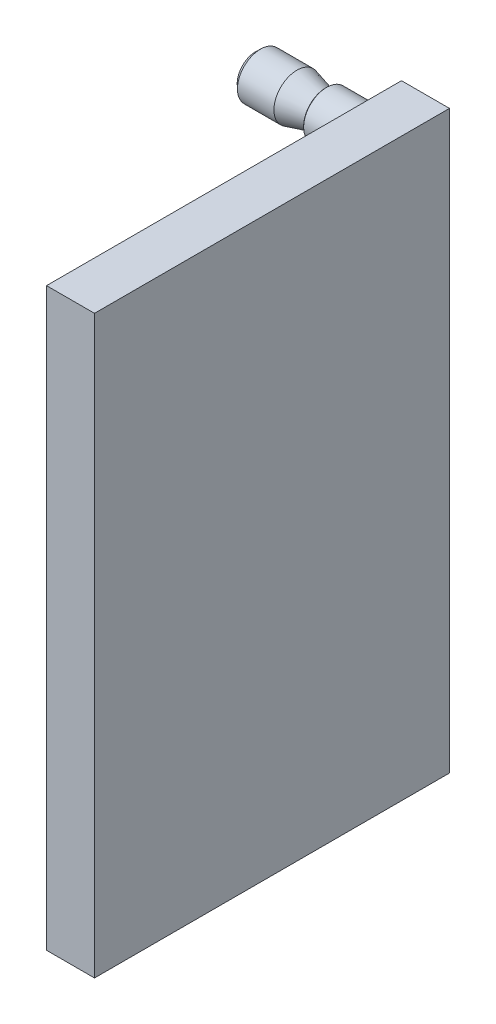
ISO-10303-21;
HEADER;
FILE_DESCRIPTION(('STEP AP214'),'2;1');
FILE_NAME('part.step','',(''),(''),'','','');
FILE_SCHEMA(('AUTOMOTIVE_DESIGN { 1 0 10303 214 1 1 1 1 }'));
ENDSEC;
DATA;
#1=APPLICATION_CONTEXT('core data for automotive mechanical design processes');
#2=APPLICATION_PROTOCOL_DEFINITION('international standard','automotive_design',2000,#1);
#3=PRODUCT_CONTEXT('',#1,'mechanical');
#4=PRODUCT('Part','Part','',(#3));
#5=PRODUCT_RELATED_PRODUCT_CATEGORY('part','',(#4));
#6=PRODUCT_DEFINITION_FORMATION('','',#4);
#7=PRODUCT_DEFINITION_CONTEXT('part definition',#1,'design');
#8=PRODUCT_DEFINITION('design','',#6,#7);
#9=PRODUCT_DEFINITION_SHAPE('','',#8);
#10=(LENGTH_UNIT() NAMED_UNIT(*) SI_UNIT(.MILLI.,.METRE.));
#11=(NAMED_UNIT(*) PLANE_ANGLE_UNIT() SI_UNIT($,.RADIAN.));
#12=(NAMED_UNIT(*) SI_UNIT($,.STERADIAN.) SOLID_ANGLE_UNIT());
#13=UNCERTAINTY_MEASURE_WITH_UNIT(LENGTH_MEASURE(1.E-05),#10,'distance_accuracy_value','');
#14=(GEOMETRIC_REPRESENTATION_CONTEXT(3) GLOBAL_UNCERTAINTY_ASSIGNED_CONTEXT((#13)) GLOBAL_UNIT_ASSIGNED_CONTEXT((#10,
#11,#12)) REPRESENTATION_CONTEXT('',''));
#15=CARTESIAN_POINT('',(0.,0.,0.));
#16=DIRECTION('',(0.,0.,1.));
#17=DIRECTION('',(1.,0.,0.));
#18=AXIS2_PLACEMENT_3D('',#15,#16,#17);
#19=CARTESIAN_POINT('',(-18.6839446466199,25.,1.90021068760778));
#20=DIRECTION('',(1.,0.,0.));
#21=DIRECTION('',(0.,0.,-1.));
#22=AXIS2_PLACEMENT_3D('',#19,#20,#21);
#23=CONICAL_SURFACE('',#22,1.34162516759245,0.991977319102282);
#24=CARTESIAN_POINT('',(-18.6839446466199,25.,1.90021068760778));
#25=DIRECTION('',(1.,0.,0.));
#26=DIRECTION('',(0.,0.,-1.));
#27=AXIS2_PLACEMENT_3D('',#24,#25,#26);
#28=CIRCLE('',#27,1.34162516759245);
#29=CARTESIAN_POINT('',(-18.68394464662,25.,0.558585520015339));
#30=VERTEX_POINT('',#29);
#31=EDGE_CURVE('E272',#30,#30,#28,.T.);
#32=ORIENTED_EDGE('',*,*,#31,.T.);
#33=EDGE_LOOP('',(#32));
#34=FACE_BOUND('',#33,.T.);
#35=CARTESIAN_POINT('',(-15.1519110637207,18.526560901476,0.));
#36=CARTESIAN_POINT('',(-15.2544568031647,18.6901191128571,0.));
#37=CARTESIAN_POINT('',(-15.356794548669,18.8538083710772,0.));
#38=CARTESIAN_POINT('',(-15.5609170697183,19.1815403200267,0.));
#39=CARTESIAN_POINT('',(-15.6627018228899,19.3455830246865,0.));
#40=CARTESIAN_POINT('',(-15.8657664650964,19.6744131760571,0.));
#41=CARTESIAN_POINT('',(-15.9670450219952,19.8392014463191,0.));
#42=CARTESIAN_POINT('',(-16.168685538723,20.1693317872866,0.));
#43=CARTESIAN_POINT('',(-16.269047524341,20.3346738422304,0.));
#44=CARTESIAN_POINT('',(-16.4827361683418,20.6896316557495,0.));
#45=CARTESIAN_POINT('',(-16.5958788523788,20.8793584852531,0.));
#46=CARTESIAN_POINT('',(-16.819916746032,21.2601620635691,0.));
#47=CARTESIAN_POINT('',(-16.930811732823,21.451238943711,0.));
#48=CARTESIAN_POINT('',(-17.149140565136,21.8351309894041,0.));
#49=CARTESIAN_POINT('',(-17.2565776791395,22.0279442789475,0.));
#50=CARTESIAN_POINT('',(-17.4137169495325,22.3193144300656,0.));
#51=CARTESIAN_POINT('',(-17.4654235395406,22.416788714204,0.));
#52=CARTESIAN_POINT('',(-17.5670981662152,22.6126378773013,0.));
#53=CARTESIAN_POINT('',(-17.6170662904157,22.7110127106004,0.));
#54=CARTESIAN_POINT('',(-17.7049791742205,22.8891261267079,0.));
#55=CARTESIAN_POINT('',(-17.7433321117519,22.968662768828,0.));
#56=CARTESIAN_POINT('',(-17.8182108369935,23.1285975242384,0.));
#57=CARTESIAN_POINT('',(-17.8547365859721,23.208995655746,0.));
#58=CARTESIAN_POINT('',(-17.92551554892,23.3709076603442,0.));
#59=CARTESIAN_POINT('',(-17.9597659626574,23.4524227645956,0.));
#60=CARTESIAN_POINT('',(-18.0253036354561,23.616644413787,0.));
#61=CARTESIAN_POINT('',(-18.0565909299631,23.6993509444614,0.));
#62=CARTESIAN_POINT('',(-18.1142915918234,23.863044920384,0.));
#63=CARTESIAN_POINT('',(-18.1408419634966,23.9439835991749,0.));
#64=CARTESIAN_POINT('',(-18.1895109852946,24.1072073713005,0.));
#65=CARTESIAN_POINT('',(-18.2116293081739,24.1894925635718,0.));
#66=CARTESIAN_POINT('',(-18.2503349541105,24.3551459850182,0.));
#67=CARTESIAN_POINT('',(-18.2669367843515,24.4385107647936,0.));
#68=CARTESIAN_POINT('',(-18.2936529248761,24.6062533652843,0.));
#69=CARTESIAN_POINT('',(-18.3037705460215,24.6906306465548,0.));
#70=CARTESIAN_POINT('',(-18.3165443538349,24.8570999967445,0.));
#71=CARTESIAN_POINT('',(-18.3194404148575,24.9391732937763,0.));
#72=CARTESIAN_POINT('',(-18.3182429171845,25.103286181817,0.));
#73=CARTESIAN_POINT('',(-18.3141477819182,25.1853257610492,0.));
#74=CARTESIAN_POINT('',(-18.2991464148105,25.3502984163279,0.));
#75=CARTESIAN_POINT('',(-18.2881155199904,25.4332199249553,0.));
#76=CARTESIAN_POINT('',(-18.2599254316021,25.5979651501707,0.));
#77=CARTESIAN_POINT('',(-18.2427679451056,25.679789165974,0.));
#78=CARTESIAN_POINT('',(-18.1895405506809,25.8989115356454,0.));
#79=CARTESIAN_POINT('',(-18.1486323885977,26.035026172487,0.));
#80=CARTESIAN_POINT('',(-18.0565914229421,26.3038052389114,0.));
#81=CARTESIAN_POINT('',(-18.0054451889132,26.4364648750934,0.));
#82=CARTESIAN_POINT('',(-17.8959561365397,26.6997303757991,0.));
#83=CARTESIAN_POINT('',(-17.8375695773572,26.8303177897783,0.));
#84=CARTESIAN_POINT('',(-17.7161155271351,27.0891883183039,0.));
#85=CARTESIAN_POINT('',(-17.6530504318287,27.2174725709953,0.));
#86=CARTESIAN_POINT('',(-17.5274938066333,27.4647652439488,0.));
#87=CARTESIAN_POINT('',(-17.4651921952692,27.5838707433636,0.));
#88=CARTESIAN_POINT('',(-17.3384536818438,27.8209571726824,0.));
#89=CARTESIAN_POINT('',(-17.2740164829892,27.9389379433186,0.));
#90=CARTESIAN_POINT('',(-17.1444746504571,28.1723618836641,0.));
#91=CARTESIAN_POINT('',(-17.0793921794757,28.2878173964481,0.));
#92=CARTESIAN_POINT('',(-16.9480410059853,28.5180120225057,0.));
#93=CARTESIAN_POINT('',(-16.8817726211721,28.6327513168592,0.));
#94=CARTESIAN_POINT('',(-16.8150715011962,28.7472339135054,0.));
#95=B_SPLINE_CURVE_WITH_KNOTS('',3,(#35,#36,#37,#38,#39,#40,#41,#42,#43,#44,#45,#46,#47,#48,#49,
#50,#51,#52,#53,#54,#55,#56,#57,#58,#59,#60,#61,#62,#63,#64,#65,#66,#67,#68,#69,#70,#71,#72,#73,
#74,#75,#76,#77,#78,#79,#80,#81,#82,#83,#84,#85,#86,#87,#88,#89,#90,#91,#92,#93,#94),
.UNSPECIFIED.,.F.,.F.,(4,2,2,2,2,2,2,2,2,2,2,2,2,2,2,2,2,2,2,2,2,2,2,2,2,2,2,2,2,4),(0.,
0.579139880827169,1.15830302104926,1.73857010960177,2.31882082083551,2.98151411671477,
3.64427279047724,4.30638541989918,4.63739156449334,4.9683810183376,5.23326542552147,
5.4981554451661,5.76336564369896,6.02857266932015,6.28401860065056,6.5394833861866,
6.79427093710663,7.04892828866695,7.29500689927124,7.54114100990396,7.79183079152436,
8.04245077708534,8.46817320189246,8.89445779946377,9.32345613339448,9.75223628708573,
10.1554558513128,10.5587316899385,10.9563309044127,11.3538251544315),.UNSPECIFIED.);
#96=CARTESIAN_POINT('',(-18.3067449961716,24.7332646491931,0.));
#97=VERTEX_POINT('',#96);
#98=CARTESIAN_POINT('',(-18.3067449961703,25.2667353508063,0.));
#99=VERTEX_POINT('',#98);
#100=EDGE_CURVE('E184',#97,#99,#95,.T.);
#101=ORIENTED_EDGE('',*,*,#100,.F.);
#102=CARTESIAN_POINT('',(-18.3067449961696,25.,1.90021068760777));
#103=DIRECTION('',(1.,0.,0.));
#104=DIRECTION('',(0.,0.,-1.));
#105=AXIS2_PLACEMENT_3D('',#102,#103,#104);
#106=CIRCLE('',#105,1.91884038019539);
#107=EDGE_CURVE('E269',#99,#97,#106,.T.);
#108=ORIENTED_EDGE('',*,*,#107,.F.);
#109=EDGE_LOOP('',(#101,#108));
#110=FACE_BOUND('',#109,.T.);
#111=ADVANCED_FACE('F14',(#34,#110),#23,.T.);
#112=CARTESIAN_POINT('',(-18.3067449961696,25.,1.90021068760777));
#113=DIRECTION('',(1.,0.,0.));
#114=DIRECTION('',(0.,0.,-1.));
#115=AXIS2_PLACEMENT_3D('',#112,#113,#114);
#116=CONICAL_SURFACE('',#115,1.91884038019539,0.760039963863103);
#117=CARTESIAN_POINT('',(-15.8429667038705,21.186469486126,0.));
#118=CARTESIAN_POINT('',(-15.9244436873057,21.2730100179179,0.));
#119=CARTESIAN_POINT('',(-16.0056414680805,21.3598157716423,0.));
#120=CARTESIAN_POINT('',(-16.1673304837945,21.5340975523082,0.));
#121=CARTESIAN_POINT('',(-16.2478216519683,21.6215736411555,0.));
#122=CARTESIAN_POINT('',(-16.4082385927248,21.7976541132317,0.));
#123=CARTESIAN_POINT('',(-16.4881610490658,21.8862615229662,0.));
#124=CARTESIAN_POINT('',(-16.6469021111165,22.0644545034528,0.));
#125=CARTESIAN_POINT('',(-16.7257207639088,22.1540400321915,0.));
#126=CARTESIAN_POINT('',(-16.8862388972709,22.3393718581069,0.));
#127=CARTESIAN_POINT('',(-16.9678594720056,22.4351866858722,0.));
#128=CARTESIAN_POINT('',(-17.1290377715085,22.6285343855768,0.));
#129=CARTESIAN_POINT('',(-17.2085956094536,22.7260671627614,0.));
#130=CARTESIAN_POINT('',(-17.3647943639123,22.9232068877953,0.));
#131=CARTESIAN_POINT('',(-17.4414395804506,23.0228104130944,0.));
#132=CARTESIAN_POINT('',(-17.5908182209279,23.224894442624,0.));
#133=CARTESIAN_POINT('',(-17.6635528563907,23.3273740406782,0.));
#134=CARTESIAN_POINT('',(-17.7826268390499,23.505201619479,0.));
#135=CARTESIAN_POINT('',(-17.8303984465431,23.579585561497,0.));
#136=CARTESIAN_POINT('',(-17.9222269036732,23.7306697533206,0.));
#137=CARTESIAN_POINT('',(-17.9662823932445,23.8073708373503,0.));
#138=CARTESIAN_POINT('',(-18.0490652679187,23.9629040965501,0.));
#139=CARTESIAN_POINT('',(-18.0878300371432,24.0417160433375,0.));
#140=CARTESIAN_POINT('',(-18.1586730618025,24.2022431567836,0.));
#141=CARTESIAN_POINT('',(-18.1907563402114,24.2839560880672,0.));
#142=CARTESIAN_POINT('',(-18.2533239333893,24.4723127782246,0.));
#143=CARTESIAN_POINT('',(-18.2811927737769,24.5798849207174,0.));
#144=CARTESIAN_POINT('',(-18.308996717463,24.7434001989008,0.));
#145=CARTESIAN_POINT('',(-18.3159315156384,24.7981871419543,0.));
#146=CARTESIAN_POINT('',(-18.3248406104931,24.9081756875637,0.));
#147=CARTESIAN_POINT('',(-18.3268150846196,24.9633772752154,0.));
#148=CARTESIAN_POINT('',(-18.3256816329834,25.0738598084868,0.));
#149=CARTESIAN_POINT('',(-18.3225613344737,25.1291406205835,0.));
#150=CARTESIAN_POINT('',(-18.311392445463,25.239197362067,0.));
#151=CARTESIAN_POINT('',(-18.3033435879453,25.2939732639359,0.));
#152=CARTESIAN_POINT('',(-18.2826932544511,25.4028483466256,0.));
#153=CARTESIAN_POINT('',(-18.2700758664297,25.456944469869,0.));
#154=CARTESIAN_POINT('',(-18.2408458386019,25.5640342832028,0.));
#155=CARTESIAN_POINT('',(-18.2242328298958,25.6170278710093,0.));
#156=CARTESIAN_POINT('',(-18.1667948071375,25.7813573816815,0.));
#157=CARTESIAN_POINT('',(-18.1199052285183,25.8905764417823,0.));
#158=CARTESIAN_POINT('',(-18.0156354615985,26.103898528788,0.));
#159=CARTESIAN_POINT('',(-17.9582364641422,26.2079919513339,0.));
#160=CARTESIAN_POINT('',(-17.8355618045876,26.4134252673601,0.));
#161=CARTESIAN_POINT('',(-17.7701842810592,26.5147036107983,0.));
#162=CARTESIAN_POINT('',(-17.6684659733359,26.6640270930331,0.));
#163=CARTESIAN_POINT('',(-17.6339652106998,26.7133507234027,0.));
#164=CARTESIAN_POINT('',(-17.5639260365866,26.8112542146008,0.));
#165=CARTESIAN_POINT('',(-17.5283876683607,26.8598341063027,0.));
#166=CARTESIAN_POINT('',(-17.4096286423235,27.0191560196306,0.));
#167=CARTESIAN_POINT('',(-17.3245487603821,27.128511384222,0.));
#168=CARTESIAN_POINT('',(-17.1512192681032,27.3446890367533,0.));
#169=CARTESIAN_POINT('',(-17.0629690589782,27.4515108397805,0.));
#170=CARTESIAN_POINT('',(-16.8841371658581,27.6632831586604,0.));
#171=CARTESIAN_POINT('',(-16.7935541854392,27.768232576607,0.));
#172=CARTESIAN_POINT('',(-16.6106857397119,27.9766402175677,0.));
#173=CARTESIAN_POINT('',(-16.5184002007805,28.0800983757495,0.));
#174=CARTESIAN_POINT('',(-16.2391330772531,28.389277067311,0.));
#175=CARTESIAN_POINT('',(-16.0502168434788,28.5932478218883,0.));
#176=CARTESIAN_POINT('',(-15.6692979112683,28.998133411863,0.));
#177=CARTESIAN_POINT('',(-15.4772962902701,29.1990492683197,0.));
#178=CARTESIAN_POINT('',(-15.1148041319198,29.5743769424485,0.));
#179=CARTESIAN_POINT('',(-14.9445563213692,29.7490235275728,0.));
#180=CARTESIAN_POINT('',(-14.6028578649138,30.0971696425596,0.));
#181=CARTESIAN_POINT('',(-14.4314070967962,30.2706690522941,0.));
#182=CARTESIAN_POINT('',(-14.0884738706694,30.6159266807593,0.));
#183=CARTESIAN_POINT('',(-13.9169958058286,30.7876892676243,0.));
#184=CARTESIAN_POINT('',(-13.5733733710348,31.1305045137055,0.));
#185=CARTESIAN_POINT('',(-13.4012290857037,31.3015572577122,0.));
#186=CARTESIAN_POINT('',(-13.2288360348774,31.4723573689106,0.));
#187=B_SPLINE_CURVE_WITH_KNOTS('',3,(#117,#118,#119,#120,#121,#122,#123,#124,#125,#126,#127,
#128,#129,#130,#131,#132,#133,#134,#135,#136,#137,#138,#139,#140,#141,#142,#143,#144,#145,#146,
#147,#148,#149,#150,#151,#152,#153,#154,#155,#156,#157,#158,#159,#160,#161,#162,#163,#164,#165,
#166,#167,#168,#169,#170,#171,#172,#173,#174,#175,#176,#177,#178,#179,#180,#181,#182,#183,#184,
#185,#186),.UNSPECIFIED.,.F.,.F.,(4,2,2,2,2,2,2,2,2,2,2,2,2,2,2,2,2,2,2,2,2,2,2,2,2,2,2,2,2,2,2,
2,2,2,4),(0.,0.356582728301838,0.713198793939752,1.0711716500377,1.42912919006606,
1.80670775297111,2.18426555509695,2.56124239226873,2.93810175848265,3.20322959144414,
3.4684540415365,3.73169490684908,3.99473715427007,4.32661386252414,4.49209272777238,
4.6575656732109,4.82344107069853,4.98932545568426,5.15579325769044,5.32227643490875,
5.67789990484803,6.034166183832,6.39558215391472,6.5761508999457,6.75671212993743,
7.17227683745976,7.58792045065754,8.00380026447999,8.41969810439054,9.25368397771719,
10.0873846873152,10.8190678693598,11.5508264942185,12.2789479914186,13.0069798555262),.UNSPECIFIED.);
#188=CARTESIAN_POINT('',(-17.8004213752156,23.5337970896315,2.64465218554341E-13));
#189=VERTEX_POINT('',#188);
#190=EDGE_CURVE('E188',#189,#97,#187,.T.);
#191=ORIENTED_EDGE('',*,*,#190,.F.);
#192=CARTESIAN_POINT('',(-17.8004213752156,25.,1.90021068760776));
#193=DIRECTION('',(1.,0.,0.));
#194=DIRECTION('',(0.,0.,-1.));
#195=AXIS2_PLACEMENT_3D('',#192,#193,#194);
#196=CIRCLE('',#195,2.40011492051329);
#197=CARTESIAN_POINT('',(-17.8004213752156,26.4662029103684,2.64465218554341E-13));
#198=VERTEX_POINT('',#197);
#199=EDGE_CURVE('E266',#198,#189,#196,.T.);
#200=ORIENTED_EDGE('',*,*,#199,.F.);
#201=EDGE_CURVE('E418',#99,#198,#187,.T.);
#202=ORIENTED_EDGE('',*,*,#201,.F.);
#203=ORIENTED_EDGE('',*,*,#107,.T.);
#204=EDGE_LOOP('',(#191,#200,#202,#203));
#205=FACE_BOUND('',#204,.T.);
#206=ADVANCED_FACE('F425',(#205),#116,.T.);
#207=CARTESIAN_POINT('',(-5.,25.,1.9002106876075));
#208=DIRECTION('',(1.,0.,0.));
#209=DIRECTION('',(0.,0.,-1.));
#210=AXIS2_PLACEMENT_3D('',#207,#208,#209);
#211=CYLINDRICAL_SURFACE('',#210,2.40011492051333);
#212=DIRECTION('',(1.,0.,0.));
#213=VECTOR('',#212,1.);
#214=CARTESIAN_POINT('',(-5.,26.4662029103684,0.));
#215=LINE('',#214,#213);
#216=CARTESIAN_POINT('',(-14.0005746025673,26.4662029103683,0.));
#217=VERTEX_POINT('',#216);
#218=EDGE_CURVE('E35',#198,#217,#215,.T.);
#219=ORIENTED_EDGE('',*,*,#218,.F.);
#220=ORIENTED_EDGE('',*,*,#199,.T.);
#221=DIRECTION('',(1.,0.,0.));
#222=VECTOR('',#221,1.);
#223=CARTESIAN_POINT('',(-5.,23.5337970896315,0.));
#224=LINE('',#223,#222);
#225=CARTESIAN_POINT('',(-14.0005746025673,23.5337970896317,0.));
#226=VERTEX_POINT('',#225);
#227=EDGE_CURVE('E578',#226,#189,#224,.F.);
#228=ORIENTED_EDGE('',*,*,#227,.F.);
#229=CARTESIAN_POINT('',(-14.0005746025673,25.,1.90021068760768));
#230=DIRECTION('',(1.,0.,0.));
#231=DIRECTION('',(0.,0.,-1.));
#232=AXIS2_PLACEMENT_3D('',#229,#230,#231);
#233=CIRCLE('',#232,2.40011492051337);
#234=EDGE_CURVE('E263',#217,#226,#233,.T.);
#235=ORIENTED_EDGE('',*,*,#234,.F.);
#236=EDGE_LOOP('',(#219,#220,#228,#235));
#237=FACE_BOUND('',#236,.T.);
#238=ADVANCED_FACE('F429',(#237),#211,.T.);
#239=CARTESIAN_POINT('',(-14.0005746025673,25.,1.90021068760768));
#240=DIRECTION('',(-1.,0.,0.));
#241=DIRECTION('',(0.,0.,1.));
#242=AXIS2_PLACEMENT_3D('',#239,#240,#241);
#243=CONICAL_SURFACE('',#242,2.40011492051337,0.26176095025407);
#244=CARTESIAN_POINT('',(-11.3775138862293,25.,1.90021068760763));
#245=DIRECTION('',(1.,0.,0.));
#246=DIRECTION('',(0.,0.,-1.));
#247=AXIS2_PLACEMENT_3D('',#244,#245,#246);
#248=CIRCLE('',#247,1.69737598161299);
#249=CARTESIAN_POINT('',(-11.3775138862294,25.,0.20283470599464));
#250=VERTEX_POINT('',#249);
#251=EDGE_CURVE('E260',#250,#250,#248,.T.);
#252=ORIENTED_EDGE('',*,*,#251,.F.);
#253=EDGE_LOOP('',(#252));
#254=FACE_BOUND('',#253,.T.);
#255=CARTESIAN_POINT('',(-16.9489185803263,22.4377161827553,0.));
#256=CARTESIAN_POINT('',(-16.805299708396,22.4856277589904,0.));
#257=CARTESIAN_POINT('',(-16.661817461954,22.5339535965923,0.));
#258=CARTESIAN_POINT('',(-16.3751901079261,22.6316250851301,0.));
#259=CARTESIAN_POINT('',(-16.2320450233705,22.6809708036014,0.));
#260=CARTESIAN_POINT('',(-15.9458405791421,22.7809838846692,0.));
#261=CARTESIAN_POINT('',(-15.8027822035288,22.831654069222,0.));
#262=CARTESIAN_POINT('',(-15.5171990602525,22.9344652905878,0.));
#263=CARTESIAN_POINT('',(-15.3746742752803,22.9866062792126,0.));
#264=CARTESIAN_POINT('',(-15.0903534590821,23.092689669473,0.));
#265=CARTESIAN_POINT('',(-14.9485571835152,23.1466314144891,0.));
#266=CARTESIAN_POINT('',(-14.665861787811,23.2568144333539,0.));
#267=CARTESIAN_POINT('',(-14.524962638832,23.3130556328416,0.));
#268=CARTESIAN_POINT('',(-14.2445230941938,23.4284834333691,0.));
#269=CARTESIAN_POINT('',(-14.104981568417,23.4876672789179,0.));
#270=CARTESIAN_POINT('',(-13.8276830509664,23.6100585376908,0.));
#271=CARTESIAN_POINT('',(-13.6899256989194,23.6732651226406,0.));
#272=CARTESIAN_POINT('',(-13.5019114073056,23.7643878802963,0.));
#273=CARTESIAN_POINT('',(-13.4504591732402,23.7898352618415,0.));
#274=CARTESIAN_POINT('',(-13.3480488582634,23.8417108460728,0.));
#275=CARTESIAN_POINT('',(-13.2970908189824,23.8681391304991,0.));
#276=CARTESIAN_POINT('',(-13.1448063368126,23.9492876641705,0.));
#277=CARTESIAN_POINT('',(-13.0443691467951,24.005728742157,0.));
#278=CARTESIAN_POINT('',(-12.8970267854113,24.0951935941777,0.));
#279=CARTESIAN_POINT('',(-12.8486046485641,24.1257174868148,0.));
#280=CARTESIAN_POINT('',(-12.7531191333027,24.1888121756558,0.));
#281=CARTESIAN_POINT('',(-12.706055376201,24.2213823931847,0.));
#282=CARTESIAN_POINT('',(-12.6139846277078,24.2889782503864,0.));
#283=CARTESIAN_POINT('',(-12.568970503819,24.3239940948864,0.));
#284=CARTESIAN_POINT('',(-12.4817133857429,24.3972933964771,0.));
#285=CARTESIAN_POINT('',(-12.4394671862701,24.4355729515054,0.));
#286=CARTESIAN_POINT('',(-12.3706621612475,24.5049212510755,0.));
#287=CARTESIAN_POINT('',(-12.3430593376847,24.5349437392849,0.));
#288=CARTESIAN_POINT('',(-12.2909410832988,24.5976912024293,0.));
#289=CARTESIAN_POINT('',(-12.2664306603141,24.6304204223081,0.));
#290=CARTESIAN_POINT('',(-12.2216794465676,24.6994074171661,0.));
#291=CARTESIAN_POINT('',(-12.201502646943,24.7357078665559,0.));
#292=CARTESIAN_POINT('',(-12.1681225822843,24.8113664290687,0.));
#293=CARTESIAN_POINT('',(-12.1548910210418,24.8507113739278,0.));
#294=CARTESIAN_POINT('',(-12.140119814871,24.9198153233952,0.));
#295=CARTESIAN_POINT('',(-12.1363151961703,24.9490870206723,0.));
#296=CARTESIAN_POINT('',(-12.1338345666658,25.0078574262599,0.));
#297=CARTESIAN_POINT('',(-12.135158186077,25.0373561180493,0.));
#298=CARTESIAN_POINT('',(-12.1427587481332,25.0955935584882,0.));
#299=CARTESIAN_POINT('',(-12.1490203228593,25.1243343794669,0.));
#300=CARTESIAN_POINT('',(-12.1657871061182,25.1805268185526,0.));
#301=CARTESIAN_POINT('',(-12.1762945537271,25.2079777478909,0.));
#302=CARTESIAN_POINT('',(-12.2085386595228,25.2784775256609,0.));
#303=CARTESIAN_POINT('',(-12.2331503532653,25.320197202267,0.));
#304=CARTESIAN_POINT('',(-12.2882616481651,25.3995735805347,0.));
#305=CARTESIAN_POINT('',(-12.3187845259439,25.4372132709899,0.));
#306=CARTESIAN_POINT('',(-12.3955189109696,25.5223080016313,0.));
#307=CARTESIAN_POINT('',(-12.4433655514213,25.5682652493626,0.));
#308=CARTESIAN_POINT('',(-12.5431923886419,25.6555100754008,0.));
#309=CARTESIAN_POINT('',(-12.5951815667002,25.6967870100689,0.));
#310=CARTESIAN_POINT('',(-12.702417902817,25.7762983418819,0.));
#311=CARTESIAN_POINT('',(-12.7576975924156,25.8144884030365,0.));
#312=CARTESIAN_POINT('',(-12.869981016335,25.8880613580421,0.));
#313=CARTESIAN_POINT('',(-12.9269826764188,25.9234474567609,0.));
#314=CARTESIAN_POINT('',(-13.0520687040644,25.9979044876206,0.));
#315=CARTESIAN_POINT('',(-13.1203884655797,26.0365778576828,0.));
#316=CARTESIAN_POINT('',(-13.2582754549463,26.1116425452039,0.));
#317=CARTESIAN_POINT('',(-13.3278429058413,26.1480334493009,0.));
#318=CARTESIAN_POINT('',(-13.5380001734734,26.2545488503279,0.));
#319=CARTESIAN_POINT('',(-13.6799587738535,26.321966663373,0.));
#320=CARTESIAN_POINT('',(-13.9665614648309,26.45218372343,0.));
#321=CARTESIAN_POINT('',(-14.1112134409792,26.5149652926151,0.));
#322=CARTESIAN_POINT('',(-14.4019392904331,26.6369726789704,0.));
#323=CARTESIAN_POINT('',(-14.5480126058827,26.696199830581,0.));
#324=CARTESIAN_POINT('',(-14.8240709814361,26.8052321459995,0.));
#325=CARTESIAN_POINT('',(-14.9539413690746,26.855329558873,0.));
#326=CARTESIAN_POINT('',(-15.2143243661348,26.9538693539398,0.));
#327=CARTESIAN_POINT('',(-15.3448370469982,27.0023115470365,0.));
#328=CARTESIAN_POINT('',(-15.6054210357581,27.0975020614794,0.));
#329=CARTESIAN_POINT('',(-15.7354888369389,27.1442600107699,0.));
#330=CARTESIAN_POINT('',(-15.9959998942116,27.236648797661,0.));
#331=CARTESIAN_POINT('',(-16.1264430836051,27.2822798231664,0.));
#332=CARTESIAN_POINT('',(-16.257040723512,27.3274583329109,0.));
#333=B_SPLINE_CURVE_WITH_KNOTS('',3,(#255,#256,#257,#258,#259,#260,#261,#262,#263,#264,#265,
#266,#267,#268,#269,#270,#271,#272,#273,#274,#275,#276,#277,#278,#279,#280,#281,#282,#283,#284,
#285,#286,#287,#288,#289,#290,#291,#292,#293,#294,#295,#296,#297,#298,#299,#300,#301,#302,#303,
#304,#305,#306,#307,#308,#309,#310,#311,#312,#313,#314,#315,#316,#317,#318,#319,#320,#321,#322,
#323,#324,#325,#326,#327,#328,#329,#330,#331,#332),.UNSPECIFIED.,.F.,.F.,(4,2,2,2,2,2,2,2,2,2,2,
2,2,2,2,2,2,2,2,2,2,2,2,2,2,2,2,2,2,2,2,2,2,2,2,2,2,2,4),(0.,0.454201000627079,
0.908432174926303,1.3637260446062,1.8190050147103,2.27411974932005,2.72921977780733,
3.18390139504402,3.63848969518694,3.81068310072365,3.98289088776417,4.3283017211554,
4.49998452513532,4.67161899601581,4.84260162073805,5.01338261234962,5.13558373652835,
5.25798028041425,5.38207585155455,5.50566183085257,5.59380081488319,5.68193344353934,
5.76979286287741,5.85769867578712,6.00216838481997,6.14721898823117,6.34574962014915,
6.54472304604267,6.74617654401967,6.9473963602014,7.18285547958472,7.41835711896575,
7.8896578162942,8.3626715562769,8.83550658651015,9.25308792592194,9.67071681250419,
10.0853624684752,10.4999385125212),.UNSPECIFIED.);
#334=EDGE_CURVE('E411',#217,#226,#333,.F.);
#335=ORIENTED_EDGE('',*,*,#334,.F.);
#336=ORIENTED_EDGE('',*,*,#234,.T.);
#337=EDGE_LOOP('',(#335,#336));
#338=FACE_BOUND('',#337,.T.);
#339=ADVANCED_FACE('F551',(#254,#338),#243,.T.);
#340=CARTESIAN_POINT('',(-11.0235946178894,25.,1.90021068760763));
#341=DIRECTION('',(1.,0.,0.));
#342=DIRECTION('',(0.,0.,-1.));
#343=AXIS2_PLACEMENT_3D('',#340,#341,#342);
#344=CONICAL_SURFACE('',#343,1.87029544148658,1.37127084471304);
#345=CARTESIAN_POINT('',(-11.0235946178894,25.,1.90021068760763));
#346=DIRECTION('',(1.,0.,0.));
#347=DIRECTION('',(0.,0.,-1.));
#348=AXIS2_PLACEMENT_3D('',#345,#346,#347);
#349=CIRCLE('',#348,1.87029544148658);
#350=CARTESIAN_POINT('',(-11.0235946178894,25.,0.0299152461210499));
#351=VERTEX_POINT('',#350);
#352=EDGE_CURVE('E248',#351,#351,#349,.T.);
#353=ORIENTED_EDGE('',*,*,#352,.T.);
#354=EDGE_LOOP('',(#353));
#355=FACE_BOUND('',#354,.T.);
#356=CARTESIAN_POINT('',(-10.7191824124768,22.2099480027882,0.));
#357=CARTESIAN_POINT('',(-10.7334022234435,22.2950421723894,0.));
#358=CARTESIAN_POINT('',(-10.7474266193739,22.3801690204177,0.));
#359=CARTESIAN_POINT('',(-10.7749869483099,22.550504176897,0.));
#360=CARTESIAN_POINT('',(-10.7885228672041,22.6357124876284,0.));
#361=CARTESIAN_POINT('',(-10.828273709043,22.8916275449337,0.));
#362=CARTESIAN_POINT('',(-10.8536061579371,23.0624735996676,0.));
#363=CARTESIAN_POINT('',(-10.9005638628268,23.4035386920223,0.));
#364=CARTESIAN_POINT('',(-10.9222124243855,23.5737544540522,0.));
#365=CARTESIAN_POINT('',(-10.9602262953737,23.914731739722,0.));
#366=CARTESIAN_POINT('',(-10.9765935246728,24.0854930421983,0.));
#367=CARTESIAN_POINT('',(-11.0018336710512,24.4284506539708,0.));
#368=CARTESIAN_POINT('',(-11.01066954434,24.6006498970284,0.));
#369=CARTESIAN_POINT('',(-11.0168838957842,24.8591285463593,0.));
#370=CARTESIAN_POINT('',(-11.0177817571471,24.9453294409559,0.));
#371=CARTESIAN_POINT('',(-11.0172030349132,25.1177216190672,0.));
#372=CARTESIAN_POINT('',(-11.0157264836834,25.2039129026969,0.));
#373=CARTESIAN_POINT('',(-11.0077980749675,25.4634004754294,0.));
#374=CARTESIAN_POINT('',(-10.9978239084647,25.6365967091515,0.));
#375=CARTESIAN_POINT('',(-10.977286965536,25.8959188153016,0.));
#376=CARTESIAN_POINT('',(-10.9695110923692,25.9822885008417,0.));
#377=CARTESIAN_POINT('',(-10.9524005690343,26.1548576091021,0.));
#378=CARTESIAN_POINT('',(-10.9430662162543,26.241057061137,0.));
#379=CARTESIAN_POINT('',(-10.9331010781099,26.3271840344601,0.));
#380=B_SPLINE_CURVE_WITH_KNOTS('',3,(#356,#357,#358,#359,#360,#361,#362,#363,#364,#365,#366,
#367,#368,#369,#370,#371,#372,#373,#374,#375,#376,#377,#378,#379),.UNSPECIFIED.,.F.,.F.,(4,2,2,
2,2,2,2,2,2,2,2,4),(0.,0.258821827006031,0.517651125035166,1.0357685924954,1.55047545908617,
2.06499500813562,2.58203090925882,2.84061707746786,3.09919972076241,3.61940295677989,
3.87955103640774,4.139649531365),.UNSPECIFIED.);
#381=CARTESIAN_POINT('',(-11.,24.4192490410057,0.));
#382=VERTEX_POINT('',#381);
#383=CARTESIAN_POINT('',(-11.,25.5807509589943,0.));
#384=VERTEX_POINT('',#383);
#385=EDGE_CURVE('E389',#382,#384,#380,.T.);
#386=ORIENTED_EDGE('',*,*,#385,.F.);
#387=CARTESIAN_POINT('',(-11.,25.,1.90021068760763));
#388=DIRECTION('',(1.,0.,0.));
#389=DIRECTION('',(0.,0.,-1.));
#390=AXIS2_PLACEMENT_3D('',#387,#388,#389);
#391=CIRCLE('',#390,1.98697567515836);
#392=EDGE_CURVE('E245',#384,#382,#391,.T.);
#393=ORIENTED_EDGE('',*,*,#392,.F.);
#394=EDGE_LOOP('',(#386,#393));
#395=FACE_BOUND('',#394,.T.);
#396=ADVANCED_FACE('F546',(#355,#395),#344,.T.);
#397=CARTESIAN_POINT('',(-11.,25.,3.88718636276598));
#398=DIRECTION('',(1.,0.,0.));
#399=DIRECTION('',(0.,0.,-1.));
#400=AXIS2_PLACEMENT_3D('',#397,#398,#399);
#401=PLANE('',#400);
#402=DIRECTION('',(0.,1.,0.));
#403=VECTOR('',#402,1.);
#404=CARTESIAN_POINT('',(-11.,25.,0.));
#405=LINE('',#404,#403);
#406=CARTESIAN_POINT('',(-11.,23.7039228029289,0.));
#407=VERTEX_POINT('',#406);
#408=EDGE_CURVE('E588',#407,#382,#405,.T.);
#409=ORIENTED_EDGE('',*,*,#408,.F.);
#410=CARTESIAN_POINT('',(-11.,25.,1.90021068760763));
#411=DIRECTION('',(1.,0.,0.));
#412=DIRECTION('',(0.,0.,-1.));
#413=AXIS2_PLACEMENT_3D('',#410,#411,#412);
#414=CIRCLE('',#413,2.30013407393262);
#415=CARTESIAN_POINT('',(-11.,26.2960771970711,0.));
#416=VERTEX_POINT('',#415);
#417=EDGE_CURVE('E242',#416,#407,#414,.T.);
#418=ORIENTED_EDGE('',*,*,#417,.F.);
#419=EDGE_CURVE('E590',#384,#416,#405,.T.);
#420=ORIENTED_EDGE('',*,*,#419,.F.);
#421=ORIENTED_EDGE('',*,*,#392,.T.);
#422=EDGE_LOOP('',(#409,#418,#420,#421));
#423=FACE_BOUND('',#422,.T.);
#424=ADVANCED_FACE('F542',(#423),#401,.F.);
#425=CARTESIAN_POINT('',(-11.,25.,1.90021068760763));
#426=DIRECTION('',(1.,0.,0.));
#427=DIRECTION('',(0.,0.,-1.));
#428=AXIS2_PLACEMENT_3D('',#425,#426,#427);
#429=CONICAL_SURFACE('',#428,2.30013407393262,0.78539816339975);
#430=CARTESIAN_POINT('',(-8.88399392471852,21.0135864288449,0.));
#431=CARTESIAN_POINT('',(-8.96791943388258,21.1065728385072,0.));
#432=CARTESIAN_POINT('',(-9.05155975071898,21.1998189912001,0.));
#433=CARTESIAN_POINT('',(-9.21811169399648,21.3869739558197,0.));
#434=CARTESIAN_POINT('',(-9.30102325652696,21.4808828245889,0.));
#435=CARTESIAN_POINT('',(-9.4661489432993,21.6697238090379,0.));
#436=CARTESIAN_POINT('',(-9.54836083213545,21.764657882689,0.));
#437=CARTESIAN_POINT('',(-9.71163670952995,21.9555037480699,0.));
#438=CARTESIAN_POINT('',(-9.79270074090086,22.0514155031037,0.));
#439=CARTESIAN_POINT('',(-9.95192018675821,22.2427368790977,0.));
#440=CARTESIAN_POINT('',(-10.0301016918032,22.3381247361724,0.));
#441=CARTESIAN_POINT('',(-10.1846091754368,22.5303901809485,0.));
#442=CARTESIAN_POINT('',(-10.2609352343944,22.6272677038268,0.));
#443=CARTESIAN_POINT('',(-10.411064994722,22.8228797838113,0.));
#444=CARTESIAN_POINT('',(-10.4848700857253,22.9216132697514,0.));
#445=CARTESIAN_POINT('',(-10.6290622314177,23.1215346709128,0.));
#446=CARTESIAN_POINT('',(-10.6994500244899,23.2227220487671,0.));
#447=CARTESIAN_POINT('',(-10.8218843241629,23.4079152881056,0.));
#448=CARTESIAN_POINT('',(-10.8747978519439,23.491343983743,0.));
#449=CARTESIAN_POINT('',(-10.9763413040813,23.660670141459,0.));
#450=CARTESIAN_POINT('',(-11.0249756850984,23.7465649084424,0.));
#451=CARTESIAN_POINT('',(-11.1167587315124,23.9220576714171,0.));
#452=CARTESIAN_POINT('',(-11.1598674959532,24.0116770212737,0.));
#453=CARTESIAN_POINT('',(-11.2184381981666,24.1489010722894,0.));
#454=CARTESIAN_POINT('',(-11.2369737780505,24.1951928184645,0.));
#455=CARTESIAN_POINT('',(-11.271625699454,24.2887102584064,0.));
#456=CARTESIAN_POINT('',(-11.2877401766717,24.3359366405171,0.));
#457=CARTESIAN_POINT('',(-11.3024541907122,24.3836200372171,0.));
#458=B_SPLINE_CURVE_WITH_KNOTS('',3,(#430,#431,#432,#433,#434,#435,#436,#437,#438,#439,#440,
#441,#442,#443,#444,#445,#446,#447,#448,#449,#450,#451,#452,#453,#454,#455,#456,#457),
.UNSPECIFIED.,.F.,.F.,(4,2,2,2,2,2,2,2,2,2,2,2,2,4),(0.,0.375780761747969,0.751594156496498,
1.12833815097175,1.50506805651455,1.8750517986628,2.24501948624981,2.61477983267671,
2.98445992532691,3.2807474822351,3.57672271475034,3.87472738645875,4.02426083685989,
4.17390884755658),.UNSPECIFIED.);
#459=CARTESIAN_POINT('',(-10.9000191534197,23.5337970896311,0.));
#460=VERTEX_POINT('',#459);
#461=EDGE_CURVE('E397',#460,#407,#458,.T.);
#462=ORIENTED_EDGE('',*,*,#461,.F.);
#463=CARTESIAN_POINT('',(-10.9000191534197,25.,1.90021068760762));
#464=DIRECTION('',(1.,0.,0.));
#465=DIRECTION('',(0.,0.,-1.));
#466=AXIS2_PLACEMENT_3D('',#463,#464,#465);
#467=CIRCLE('',#466,2.40011492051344);
#468=CARTESIAN_POINT('',(-10.9000191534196,26.4662029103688,1.21898319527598E-13));
#469=VERTEX_POINT('',#468);
#470=EDGE_CURVE('E239',#469,#460,#467,.T.);
#471=ORIENTED_EDGE('',*,*,#470,.F.);
#472=CARTESIAN_POINT('',(-11.3024541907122,25.6163799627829,0.));
#473=CARTESIAN_POINT('',(-11.2877401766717,25.6640633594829,0.));
#474=CARTESIAN_POINT('',(-11.271625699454,25.7112897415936,0.));
#475=CARTESIAN_POINT('',(-11.2369737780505,25.8048071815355,0.));
#476=CARTESIAN_POINT('',(-11.2184381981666,25.8510989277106,0.));
#477=CARTESIAN_POINT('',(-11.1598674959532,25.9883229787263,0.));
#478=CARTESIAN_POINT('',(-11.1167587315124,26.0779423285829,0.));
#479=CARTESIAN_POINT('',(-11.0249756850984,26.2534350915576,0.));
#480=CARTESIAN_POINT('',(-10.9763413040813,26.339329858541,0.));
#481=CARTESIAN_POINT('',(-10.8747978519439,26.508656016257,0.));
#482=CARTESIAN_POINT('',(-10.8218843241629,26.5920847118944,0.));
#483=CARTESIAN_POINT('',(-10.6994500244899,26.7772779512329,0.));
#484=CARTESIAN_POINT('',(-10.6290622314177,26.8784653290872,0.));
#485=CARTESIAN_POINT('',(-10.4848700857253,27.0783867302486,0.));
#486=CARTESIAN_POINT('',(-10.411064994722,27.1771202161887,0.));
#487=CARTESIAN_POINT('',(-10.2609352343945,27.3727322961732,0.));
#488=CARTESIAN_POINT('',(-10.1846091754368,27.4696098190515,0.));
#489=CARTESIAN_POINT('',(-10.0301016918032,27.6618752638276,0.));
#490=CARTESIAN_POINT('',(-9.95192018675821,27.7572631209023,0.));
#491=CARTESIAN_POINT('',(-9.79270074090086,27.9485844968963,0.));
#492=CARTESIAN_POINT('',(-9.71163670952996,28.0444962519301,0.));
#493=CARTESIAN_POINT('',(-9.54836083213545,28.235342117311,0.));
#494=CARTESIAN_POINT('',(-9.4661489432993,28.3302761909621,0.));
#495=CARTESIAN_POINT('',(-9.30102325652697,28.5191171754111,0.));
#496=CARTESIAN_POINT('',(-9.21811169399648,28.6130260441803,0.));
#497=CARTESIAN_POINT('',(-9.05155975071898,28.8001810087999,0.));
#498=CARTESIAN_POINT('',(-8.96791943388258,28.8934271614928,0.));
#499=CARTESIAN_POINT('',(-8.88399392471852,28.9864135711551,0.));
#500=B_SPLINE_CURVE_WITH_KNOTS('',3,(#472,#473,#474,#475,#476,#477,#478,#479,#480,#481,#482,
#483,#484,#485,#486,#487,#488,#489,#490,#491,#492,#493,#494,#495,#496,#497,#498,#499),
.UNSPECIFIED.,.F.,.F.,(4,2,2,2,2,2,2,2,2,2,2,2,2,4),(0.,0.149648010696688,0.299181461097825,
0.597186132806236,0.893161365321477,1.18944892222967,1.55912901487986,1.92888936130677,
2.29885704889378,2.66884079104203,3.04557069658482,3.42231469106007,3.79812808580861,
4.17390884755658),.UNSPECIFIED.);
#501=EDGE_CURVE('E380',#416,#469,#500,.T.);
#502=ORIENTED_EDGE('',*,*,#501,.F.);
#503=ORIENTED_EDGE('',*,*,#417,.T.);
#504=EDGE_LOOP('',(#462,#471,#502,#503));
#505=FACE_BOUND('',#504,.T.);
#506=ADVANCED_FACE('F537',(#505),#429,.T.);
#507=CARTESIAN_POINT('',(-5.,25.,1.9002106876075));
#508=DIRECTION('',(1.,0.,0.));
#509=DIRECTION('',(0.,0.,-1.));
#510=AXIS2_PLACEMENT_3D('',#507,#508,#509);
#511=CYLINDRICAL_SURFACE('',#510,2.4001149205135);
#512=DIRECTION('',(1.,0.,0.));
#513=VECTOR('',#512,1.);
#514=CARTESIAN_POINT('',(-5.,26.4662029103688,0.));
#515=LINE('',#514,#513);
#516=CARTESIAN_POINT('',(-5.09998084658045,26.4662029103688,0.));
#517=VERTEX_POINT('',#516);
#518=EDGE_CURVE('E43',#469,#517,#515,.T.);
#519=ORIENTED_EDGE('',*,*,#518,.F.);
#520=ORIENTED_EDGE('',*,*,#470,.T.);
#521=DIRECTION('',(1.,0.,0.));
#522=VECTOR('',#521,1.);
#523=CARTESIAN_POINT('',(-5.,23.5337970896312,0.));
#524=LINE('',#523,#522);
#525=CARTESIAN_POINT('',(-5.09998084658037,23.5337970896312,0.));
#526=VERTEX_POINT('',#525);
#527=EDGE_CURVE('E585',#526,#460,#524,.F.);
#528=ORIENTED_EDGE('',*,*,#527,.F.);
#529=CARTESIAN_POINT('',(-5.09998084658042,25.,1.9002106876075));
#530=DIRECTION('',(1.,0.,0.));
#531=DIRECTION('',(0.,0.,-1.));
#532=AXIS2_PLACEMENT_3D('',#529,#530,#531);
#533=CIRCLE('',#532,2.40011492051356);
#534=EDGE_CURVE('E236',#517,#526,#533,.T.);
#535=ORIENTED_EDGE('',*,*,#534,.F.);
#536=EDGE_LOOP('',(#519,#520,#528,#535));
#537=FACE_BOUND('',#536,.T.);
#538=ADVANCED_FACE('F533',(#537),#511,.T.);
#539=CARTESIAN_POINT('',(-5.09998084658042,25.,1.9002106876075));
#540=DIRECTION('',(-1.,0.,0.));
#541=DIRECTION('',(0.,0.,1.));
#542=AXIS2_PLACEMENT_3D('',#539,#540,#541);
#543=CONICAL_SURFACE('',#542,2.40011492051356,0.785398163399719);
#544=CARTESIAN_POINT('',(-4.69754581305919,24.383620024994,0.));
#545=CARTESIAN_POINT('',(-4.7122598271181,24.3359366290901,0.));
#546=CARTESIAN_POINT('',(-4.728374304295,24.2887102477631,0.));
#547=CARTESIAN_POINT('',(-4.76302622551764,24.1951928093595,0.));
#548=CARTESIAN_POINT('',(-4.78156180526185,24.1489010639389,0.));
#549=CARTESIAN_POINT('',(-4.84013250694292,24.0116770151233,0.));
#550=CARTESIAN_POINT('',(-4.88324127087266,23.9220576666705,0.));
#551=CARTESIAN_POINT('',(-4.97502431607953,23.7465649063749,0.));
#552=CARTESIAN_POINT('',(-5.0236586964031,23.6606701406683,0.));
#553=CARTESIAN_POINT('',(-5.12520214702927,23.491343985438,0.));
#554=CARTESIAN_POINT('',(-5.17811567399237,23.4079152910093,0.));
#555=CARTESIAN_POINT('',(-5.30054997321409,23.2227220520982,0.));
#556=CARTESIAN_POINT('',(-5.37093776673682,23.1215346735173,0.));
#557=CARTESIAN_POINT('',(-5.51512991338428,22.9216132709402,0.));
#558=CARTESIAN_POINT('',(-5.58893500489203,22.8228797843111,0.));
#559=CARTESIAN_POINT('',(-5.73906476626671,22.6272677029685,0.));
#560=CARTESIAN_POINT('',(-5.81539082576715,22.5303901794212,0.));
#561=CARTESIAN_POINT('',(-5.96989831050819,22.3381247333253,0.));
#562=CARTESIAN_POINT('',(-6.04807981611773,22.2427368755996,0.));
#563=CARTESIAN_POINT('',(-6.20729926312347,22.0514154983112,0.));
#564=CARTESIAN_POINT('',(-6.28836329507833,21.9555037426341,0.));
#565=CARTESIAN_POINT('',(-6.45163917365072,21.7646578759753,0.));
#566=CARTESIAN_POINT('',(-6.53385106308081,21.6697238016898,0.));
#567=CARTESIAN_POINT('',(-6.69897675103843,21.4808828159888,0.));
#568=CARTESIAN_POINT('',(-6.78188831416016,21.3869739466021,0.));
#569=CARTESIAN_POINT('',(-6.9484402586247,21.199818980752,0.));
#570=CARTESIAN_POINT('',(-7.03208057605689,21.1065728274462,0.));
#571=CARTESIAN_POINT('',(-7.11600608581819,21.0135864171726,0.));
#572=B_SPLINE_CURVE_WITH_KNOTS('',3,(#544,#545,#546,#547,#548,#549,#550,#551,#552,#553,#554,
#555,#556,#557,#558,#559,#560,#561,#562,#563,#564,#565,#566,#567,#568,#569,#570,#571),
.UNSPECIFIED.,.F.,.F.,(4,2,2,2,2,2,2,2,2,2,2,2,2,4),(0.,0.149648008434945,0.299181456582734,
0.597186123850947,0.893161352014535,1.18944890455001,1.55912899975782,1.92888934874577,
2.29885703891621,2.66884078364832,3.04557069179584,3.42231468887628,3.79812808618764,
4.17390885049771),.UNSPECIFIED.);
#573=CARTESIAN_POINT('',(-5.,23.7039228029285,0.));
#574=VERTEX_POINT('',#573);
#575=EDGE_CURVE('E405',#574,#526,#572,.T.);
#576=ORIENTED_EDGE('',*,*,#575,.F.);
#577=CARTESIAN_POINT('',(-5.,25.,1.9002106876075));
#578=DIRECTION('',(1.,0.,0.));
#579=DIRECTION('',(0.,0.,-1.));
#580=AXIS2_PLACEMENT_3D('',#577,#578,#579);
#581=CIRCLE('',#580,2.30013407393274);
#582=CARTESIAN_POINT('',(-5.00000000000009,26.2960771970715,0.));
#583=VERTEX_POINT('',#582);
#584=EDGE_CURVE('E179',#583,#574,#581,.T.);
#585=ORIENTED_EDGE('',*,*,#584,.F.);
#586=CARTESIAN_POINT('',(-7.11600608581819,28.9864135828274,0.));
#587=CARTESIAN_POINT('',(-7.03208057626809,28.8934271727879,0.));
#588=CARTESIAN_POINT('',(-6.94844025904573,28.8001810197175,0.));
#589=CARTESIAN_POINT('',(-6.78188831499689,28.6130260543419,0.));
#590=CARTESIAN_POINT('',(-6.69897675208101,28.5191171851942,0.));
#591=CARTESIAN_POINT('',(-6.53385106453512,28.3302761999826,0.));
#592=CARTESIAN_POINT('',(-6.45163917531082,28.2353421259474,0.));
#593=CARTESIAN_POINT('',(-6.28836329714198,28.0444962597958,0.));
#594=CARTESIAN_POINT('',(-6.20729926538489,27.9485845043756,0.));
#595=CARTESIAN_POINT('',(-6.04807981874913,27.7572631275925,0.));
#596=CARTESIAN_POINT('',(-5.9698983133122,27.661875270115,0.));
#597=CARTESIAN_POINT('',(-5.81539082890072,27.4696098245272,0.));
#598=CARTESIAN_POINT('',(-5.73906476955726,27.3727323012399,0.));
#599=CARTESIAN_POINT('',(-5.58893500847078,27.177120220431,0.));
#600=CARTESIAN_POINT('',(-5.51512991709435,27.0783867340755,0.));
#601=CARTESIAN_POINT('',(-5.37093777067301,26.8784653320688,0.));
#602=CARTESIAN_POINT('',(-5.3005499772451,26.7772779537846,0.));
#603=CARTESIAN_POINT('',(-5.17811567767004,26.5920847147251,0.));
#604=CARTESIAN_POINT('',(-5.12520215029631,26.5086560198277,0.));
#605=CARTESIAN_POINT('',(-5.02365869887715,26.3393298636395,0.));
#606=CARTESIAN_POINT('',(-4.97502431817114,26.2534350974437,0.));
#607=CARTESIAN_POINT('',(-4.88324127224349,26.0779423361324,0.));
#608=CARTESIAN_POINT('',(-4.84013250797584,25.9883229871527,0.));
#609=CARTESIAN_POINT('',(-4.78156180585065,25.8510989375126,0.));
#610=CARTESIAN_POINT('',(-4.76302622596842,25.8048071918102,0.));
#611=CARTESIAN_POINT('',(-4.72837430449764,25.7112897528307,0.));
#612=CARTESIAN_POINT('',(-4.71225982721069,25.6640633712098,0.));
#613=CARTESIAN_POINT('',(-4.69754581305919,25.6163799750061,0.));
#614=B_SPLINE_CURVE_WITH_KNOTS('',3,(#586,#587,#588,#589,#590,#591,#592,#593,#594,#595,#596,
#597,#598,#599,#600,#601,#602,#603,#604,#605,#606,#607,#608,#609,#610,#611,#612,#613),
.UNSPECIFIED.,.F.,.F.,(4,2,2,2,2,2,2,2,2,2,2,2,2,4),(0.,0.375780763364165,0.751594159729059,
1.12833815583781,1.50506806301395,1.8750518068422,2.2450194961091,2.61477984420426,
2.98445993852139,3.28074749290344,3.57672272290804,3.8747273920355,4.02426084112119,
4.17390885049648),.UNSPECIFIED.);
#615=EDGE_CURVE('E371',#517,#583,#614,.T.);
#616=ORIENTED_EDGE('',*,*,#615,.F.);
#617=ORIENTED_EDGE('',*,*,#534,.T.);
#618=EDGE_LOOP('',(#576,#585,#616,#617));
#619=FACE_BOUND('',#618,.T.);
#620=ADVANCED_FACE('F521',(#619),#543,.T.);
#621=CARTESIAN_POINT('',(-18.6839446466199,-25.,1.90021068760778));
#622=DIRECTION('',(1.,0.,0.));
#623=DIRECTION('',(0.,0.,-1.));
#624=AXIS2_PLACEMENT_3D('',#621,#622,#623);
#625=CONICAL_SURFACE('',#624,1.34162516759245,0.991977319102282);
#626=CARTESIAN_POINT('',(-18.6839446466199,-25.,1.90021068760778));
#627=DIRECTION('',(1.,0.,0.));
#628=DIRECTION('',(0.,0.,-1.));
#629=AXIS2_PLACEMENT_3D('',#626,#627,#628);
#630=CIRCLE('',#629,1.34162516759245);
#631=CARTESIAN_POINT('',(-18.68394464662,-25.,0.558585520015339));
#632=VERTEX_POINT('',#631);
#633=EDGE_CURVE('E229',#632,#632,#630,.T.);
#634=ORIENTED_EDGE('',*,*,#633,.T.);
#635=EDGE_LOOP('',(#634));
#636=FACE_BOUND('',#635,.T.);
#637=CARTESIAN_POINT('',(-15.1519110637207,-31.473439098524,0.));
#638=CARTESIAN_POINT('',(-15.2544568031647,-31.3098808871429,0.));
#639=CARTESIAN_POINT('',(-15.356794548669,-31.1461916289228,0.));
#640=CARTESIAN_POINT('',(-15.5609170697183,-30.8184596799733,0.));
#641=CARTESIAN_POINT('',(-15.6627018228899,-30.6544169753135,0.));
#642=CARTESIAN_POINT('',(-15.8657664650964,-30.3255868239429,0.));
#643=CARTESIAN_POINT('',(-15.9670450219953,-30.1607985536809,0.));
#644=CARTESIAN_POINT('',(-16.168685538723,-29.8306682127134,0.));
#645=CARTESIAN_POINT('',(-16.269047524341,-29.6653261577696,0.));
#646=CARTESIAN_POINT('',(-16.4827361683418,-29.3103683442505,0.));
#647=CARTESIAN_POINT('',(-16.5958788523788,-29.1206415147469,0.));
#648=CARTESIAN_POINT('',(-16.819916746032,-28.7398379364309,0.));
#649=CARTESIAN_POINT('',(-16.930811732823,-28.548761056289,0.));
#650=CARTESIAN_POINT('',(-17.149140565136,-28.1648690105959,0.));
#651=CARTESIAN_POINT('',(-17.2565776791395,-27.9720557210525,0.));
#652=CARTESIAN_POINT('',(-17.4137169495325,-27.6806855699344,0.));
#653=CARTESIAN_POINT('',(-17.4654235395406,-27.583211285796,0.));
#654=CARTESIAN_POINT('',(-17.5670981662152,-27.3873621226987,0.));
#655=CARTESIAN_POINT('',(-17.6170662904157,-27.2889872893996,0.));
#656=CARTESIAN_POINT('',(-17.7049791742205,-27.1108738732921,0.));
#657=CARTESIAN_POINT('',(-17.7433321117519,-27.031337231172,0.));
#658=CARTESIAN_POINT('',(-17.8182108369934,-26.8714024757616,0.));
#659=CARTESIAN_POINT('',(-17.8547365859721,-26.791004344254,0.));
#660=CARTESIAN_POINT('',(-17.92551554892,-26.6290923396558,0.));
#661=CARTESIAN_POINT('',(-17.9597659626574,-26.5475772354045,0.));
#662=CARTESIAN_POINT('',(-18.0253036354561,-26.383355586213,0.));
#663=CARTESIAN_POINT('',(-18.0565909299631,-26.3006490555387,0.));
#664=CARTESIAN_POINT('',(-18.1142915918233,-26.136955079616,0.));
#665=CARTESIAN_POINT('',(-18.1408419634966,-26.0560164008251,0.));
#666=CARTESIAN_POINT('',(-18.1895109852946,-25.8927926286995,0.));
#667=CARTESIAN_POINT('',(-18.2116293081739,-25.8105074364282,0.));
#668=CARTESIAN_POINT('',(-18.2503349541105,-25.6448540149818,0.));
#669=CARTESIAN_POINT('',(-18.2669367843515,-25.5614892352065,0.));
#670=CARTESIAN_POINT('',(-18.2936529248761,-25.3937466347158,0.));
#671=CARTESIAN_POINT('',(-18.3037705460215,-25.3093693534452,0.));
#672=CARTESIAN_POINT('',(-18.3165443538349,-25.1429000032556,0.));
#673=CARTESIAN_POINT('',(-18.3194404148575,-25.0608267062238,0.));
#674=CARTESIAN_POINT('',(-18.3182429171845,-24.896713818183,0.));
#675=CARTESIAN_POINT('',(-18.3141477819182,-24.8146742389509,0.));
#676=CARTESIAN_POINT('',(-18.2991464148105,-24.6497015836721,0.));
#677=CARTESIAN_POINT('',(-18.2881155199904,-24.5667800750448,0.));
#678=CARTESIAN_POINT('',(-18.2599254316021,-24.4020348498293,0.));
#679=CARTESIAN_POINT('',(-18.2427679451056,-24.320210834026,0.));
#680=CARTESIAN_POINT('',(-18.1895405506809,-24.1010884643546,0.));
#681=CARTESIAN_POINT('',(-18.1486323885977,-23.964973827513,0.));
#682=CARTESIAN_POINT('',(-18.0565914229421,-23.6961947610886,0.));
#683=CARTESIAN_POINT('',(-18.0054451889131,-23.5635351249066,0.));
#684=CARTESIAN_POINT('',(-17.8959561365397,-23.3002696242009,0.));
#685=CARTESIAN_POINT('',(-17.8375695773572,-23.1696822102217,0.));
#686=CARTESIAN_POINT('',(-17.7161155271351,-22.9108116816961,0.));
#687=CARTESIAN_POINT('',(-17.6530504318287,-22.7825274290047,0.));
#688=CARTESIAN_POINT('',(-17.5274938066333,-22.5352347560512,0.));
#689=CARTESIAN_POINT('',(-17.4651921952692,-22.4161292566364,0.));
#690=CARTESIAN_POINT('',(-17.3384536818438,-22.1790428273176,0.));
#691=CARTESIAN_POINT('',(-17.2740164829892,-22.0610620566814,0.));
#692=CARTESIAN_POINT('',(-17.1444746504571,-21.8276381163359,0.));
#693=CARTESIAN_POINT('',(-17.0793921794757,-21.7121826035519,0.));
#694=CARTESIAN_POINT('',(-16.9480410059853,-21.4819879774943,0.));
#695=CARTESIAN_POINT('',(-16.8817726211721,-21.3672486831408,0.));
#696=CARTESIAN_POINT('',(-16.8150715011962,-21.2527660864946,0.));
#697=B_SPLINE_CURVE_WITH_KNOTS('',3,(#637,#638,#639,#640,#641,#642,#643,#644,#645,#646,#647,
#648,#649,#650,#651,#652,#653,#654,#655,#656,#657,#658,#659,#660,#661,#662,#663,#664,#665,#666,
#667,#668,#669,#670,#671,#672,#673,#674,#675,#676,#677,#678,#679,#680,#681,#682,#683,#684,#685,
#686,#687,#688,#689,#690,#691,#692,#693,#694,#695,#696),.UNSPECIFIED.,.F.,.F.,(4,2,2,2,2,2,2,2,
2,2,2,2,2,2,2,2,2,2,2,2,2,2,2,2,2,2,2,2,2,4),(0.,0.579139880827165,1.15830302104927,
1.73857010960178,2.31882082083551,2.98151411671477,3.64427279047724,4.30638541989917,
4.63739156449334,4.96838101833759,5.23326542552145,5.49815544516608,5.76336564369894,
6.02857266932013,6.28401860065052,6.53948338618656,6.79427093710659,7.04892828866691,
7.2950068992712,7.54114100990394,7.79183079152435,8.04245077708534,8.46817320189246,
8.89445779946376,9.32345613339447,9.75223628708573,10.1554558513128,10.5587316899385,
10.9563309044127,11.3538251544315),.UNSPECIFIED.);
#698=CARTESIAN_POINT('',(-18.3067449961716,-25.2667353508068,0.));
#699=VERTEX_POINT('',#698);
#700=CARTESIAN_POINT('',(-18.3067449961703,-24.7332646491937,0.));
#701=VERTEX_POINT('',#700);
#702=EDGE_CURVE('E363',#699,#701,#697,.T.);
#703=ORIENTED_EDGE('',*,*,#702,.F.);
#704=CARTESIAN_POINT('',(-18.3067449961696,-25.,1.90021068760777));
#705=DIRECTION('',(1.,0.,0.));
#706=DIRECTION('',(0.,0.,-1.));
#707=AXIS2_PLACEMENT_3D('',#704,#705,#706);
#708=CIRCLE('',#707,1.91884038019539);
#709=EDGE_CURVE('E226',#701,#699,#708,.T.);
#710=ORIENTED_EDGE('',*,*,#709,.F.);
#711=EDGE_LOOP('',(#703,#710));
#712=FACE_BOUND('',#711,.T.);
#713=ADVANCED_FACE('F516',(#636,#712),#625,.T.);
#714=CARTESIAN_POINT('',(-18.3067449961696,-25.,1.90021068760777));
#715=DIRECTION('',(1.,0.,0.));
#716=DIRECTION('',(0.,0.,-1.));
#717=AXIS2_PLACEMENT_3D('',#714,#715,#716);
#718=CONICAL_SURFACE('',#717,1.91884038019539,0.760039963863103);
#719=CARTESIAN_POINT('',(-15.8429667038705,-28.8135305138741,0.));
#720=CARTESIAN_POINT('',(-15.9244436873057,-28.7269899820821,0.));
#721=CARTESIAN_POINT('',(-16.0056414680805,-28.6401842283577,0.));
#722=CARTESIAN_POINT('',(-16.1673304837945,-28.4659024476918,0.));
#723=CARTESIAN_POINT('',(-16.2478216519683,-28.3784263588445,0.));
#724=CARTESIAN_POINT('',(-16.4082385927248,-28.2023458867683,0.));
#725=CARTESIAN_POINT('',(-16.4881610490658,-28.1137384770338,0.));
#726=CARTESIAN_POINT('',(-16.6469021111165,-27.9355454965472,0.));
#727=CARTESIAN_POINT('',(-16.7257207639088,-27.8459599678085,0.));
#728=CARTESIAN_POINT('',(-16.8862388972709,-27.6606281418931,0.));
#729=CARTESIAN_POINT('',(-16.9678594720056,-27.5648133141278,0.));
#730=CARTESIAN_POINT('',(-17.1290377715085,-27.3714656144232,0.));
#731=CARTESIAN_POINT('',(-17.2085956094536,-27.2739328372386,0.));
#732=CARTESIAN_POINT('',(-17.3647943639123,-27.0767931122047,0.));
#733=CARTESIAN_POINT('',(-17.4414395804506,-26.9771895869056,0.));
#734=CARTESIAN_POINT('',(-17.5908182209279,-26.775105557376,0.));
#735=CARTESIAN_POINT('',(-17.6635528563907,-26.6726259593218,0.));
#736=CARTESIAN_POINT('',(-17.7826268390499,-26.494798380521,0.));
#737=CARTESIAN_POINT('',(-17.8303984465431,-26.420414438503,0.));
#738=CARTESIAN_POINT('',(-17.9222269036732,-26.2693302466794,0.));
#739=CARTESIAN_POINT('',(-17.9662823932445,-26.1926291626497,0.));
#740=CARTESIAN_POINT('',(-18.0490652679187,-26.0370959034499,0.));
#741=CARTESIAN_POINT('',(-18.0878300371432,-25.9582839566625,0.));
#742=CARTESIAN_POINT('',(-18.1586730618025,-25.7977568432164,0.));
#743=CARTESIAN_POINT('',(-18.1907563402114,-25.7160439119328,0.));
#744=CARTESIAN_POINT('',(-18.2533239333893,-25.5276872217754,0.));
#745=CARTESIAN_POINT('',(-18.2811927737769,-25.4201150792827,0.));
#746=CARTESIAN_POINT('',(-18.308996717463,-25.2565998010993,0.));
#747=CARTESIAN_POINT('',(-18.3159315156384,-25.2018128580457,0.));
#748=CARTESIAN_POINT('',(-18.3248406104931,-25.0918243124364,0.));
#749=CARTESIAN_POINT('',(-18.3268150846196,-25.0366227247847,0.));
#750=CARTESIAN_POINT('',(-18.3256816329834,-24.9261401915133,0.));
#751=CARTESIAN_POINT('',(-18.3225613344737,-24.8708593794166,0.));
#752=CARTESIAN_POINT('',(-18.311392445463,-24.760802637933,0.));
#753=CARTESIAN_POINT('',(-18.3033435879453,-24.7060267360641,0.));
#754=CARTESIAN_POINT('',(-18.2826932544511,-24.5971516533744,0.));
#755=CARTESIAN_POINT('',(-18.2700758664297,-24.543055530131,0.));
#756=CARTESIAN_POINT('',(-18.2408458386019,-24.4359657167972,0.));
#757=CARTESIAN_POINT('',(-18.2242328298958,-24.3829721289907,0.));
#758=CARTESIAN_POINT('',(-18.1667948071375,-24.2186426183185,0.));
#759=CARTESIAN_POINT('',(-18.1199052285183,-24.1094235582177,0.));
#760=CARTESIAN_POINT('',(-18.0156354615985,-23.896101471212,0.));
#761=CARTESIAN_POINT('',(-17.9582364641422,-23.7920080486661,0.));
#762=CARTESIAN_POINT('',(-17.8355618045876,-23.5865747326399,0.));
#763=CARTESIAN_POINT('',(-17.7701842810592,-23.4852963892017,0.));
#764=CARTESIAN_POINT('',(-17.6684659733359,-23.3359729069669,0.));
#765=CARTESIAN_POINT('',(-17.6339652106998,-23.2866492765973,0.));
#766=CARTESIAN_POINT('',(-17.5639260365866,-23.1887457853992,0.));
#767=CARTESIAN_POINT('',(-17.5283876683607,-23.1401658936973,0.));
#768=CARTESIAN_POINT('',(-17.4096286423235,-22.9808439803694,0.));
#769=CARTESIAN_POINT('',(-17.3245487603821,-22.871488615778,0.));
#770=CARTESIAN_POINT('',(-17.1512192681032,-22.6553109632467,0.));
#771=CARTESIAN_POINT('',(-17.0629690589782,-22.5484891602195,0.));
#772=CARTESIAN_POINT('',(-16.8841371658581,-22.3367168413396,0.));
#773=CARTESIAN_POINT('',(-16.7935541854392,-22.231767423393,0.));
#774=CARTESIAN_POINT('',(-16.6106857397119,-22.0233597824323,0.));
#775=CARTESIAN_POINT('',(-16.5184002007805,-21.9199016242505,0.));
#776=CARTESIAN_POINT('',(-16.2391330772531,-21.610722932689,0.));
#777=CARTESIAN_POINT('',(-16.0502168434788,-21.4067521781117,0.));
#778=CARTESIAN_POINT('',(-15.6692979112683,-21.001866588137,0.));
#779=CARTESIAN_POINT('',(-15.4772962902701,-20.8009507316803,0.));
#780=CARTESIAN_POINT('',(-15.1148041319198,-20.4256230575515,0.));
#781=CARTESIAN_POINT('',(-14.9445563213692,-20.2509764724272,0.));
#782=CARTESIAN_POINT('',(-14.6028578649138,-19.9028303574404,0.));
#783=CARTESIAN_POINT('',(-14.4314070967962,-19.7293309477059,0.));
#784=CARTESIAN_POINT('',(-14.0884738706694,-19.3840733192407,0.));
#785=CARTESIAN_POINT('',(-13.9169958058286,-19.2123107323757,0.));
#786=CARTESIAN_POINT('',(-13.5733733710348,-18.8694954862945,0.));
#787=CARTESIAN_POINT('',(-13.4012290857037,-18.6984427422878,0.));
#788=CARTESIAN_POINT('',(-13.2288360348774,-18.5276426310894,0.));
#789=B_SPLINE_CURVE_WITH_KNOTS('',3,(#719,#720,#721,#722,#723,#724,#725,#726,#727,#728,#729,
#730,#731,#732,#733,#734,#735,#736,#737,#738,#739,#740,#741,#742,#743,#744,#745,#746,#747,#748,
#749,#750,#751,#752,#753,#754,#755,#756,#757,#758,#759,#760,#761,#762,#763,#764,#765,#766,#767,
#768,#769,#770,#771,#772,#773,#774,#775,#776,#777,#778,#779,#780,#781,#782,#783,#784,#785,#786,
#787,#788),.UNSPECIFIED.,.F.,.F.,(4,2,2,2,2,2,2,2,2,2,2,2,2,2,2,2,2,2,2,2,2,2,2,2,2,2,2,2,2,2,2,
2,2,2,4),(0.,0.356582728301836,0.713198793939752,1.07117165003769,1.42912919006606,
1.80670775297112,2.18426555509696,2.56124239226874,2.93810175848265,3.20322959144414,
3.4684540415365,3.73169490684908,3.99473715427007,4.32661386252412,4.49209272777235,
4.65756567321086,4.8234410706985,4.98932545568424,5.15579325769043,5.32227643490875,
5.67789990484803,6.03416618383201,6.39558215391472,6.5761508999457,6.75671212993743,
7.17227683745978,7.58792045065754,8.00380026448,8.41969810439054,9.2536839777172,
10.0873846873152,10.8190678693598,11.5508264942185,12.2789479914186,13.0069798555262),.UNSPECIFIED.);
#790=CARTESIAN_POINT('',(-17.8004213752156,-26.4662029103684,2.64465218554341E-13));
#791=VERTEX_POINT('',#790);
#792=EDGE_CURVE('E595',#791,#699,#789,.T.);
#793=ORIENTED_EDGE('',*,*,#792,.F.);
#794=CARTESIAN_POINT('',(-17.8004213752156,-25.,1.90021068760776));
#795=DIRECTION('',(1.,0.,0.));
#796=DIRECTION('',(0.,0.,-1.));
#797=AXIS2_PLACEMENT_3D('',#794,#795,#796);
#798=CIRCLE('',#797,2.40011492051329);
#799=CARTESIAN_POINT('',(-17.8004213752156,-23.5337970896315,2.64465218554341E-13));
#800=VERTEX_POINT('',#799);
#801=EDGE_CURVE('E223',#800,#791,#798,.T.);
#802=ORIENTED_EDGE('',*,*,#801,.F.);
#803=EDGE_CURVE('E354',#701,#800,#789,.T.);
#804=ORIENTED_EDGE('',*,*,#803,.F.);
#805=ORIENTED_EDGE('',*,*,#709,.T.);
#806=EDGE_LOOP('',(#793,#802,#804,#805));
#807=FACE_BOUND('',#806,.T.);
#808=ADVANCED_FACE('F512',(#807),#718,.T.);
#809=CARTESIAN_POINT('',(-5.,-25.,1.9002106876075));
#810=DIRECTION('',(1.,0.,0.));
#811=DIRECTION('',(0.,0.,-1.));
#812=AXIS2_PLACEMENT_3D('',#809,#810,#811);
#813=CYLINDRICAL_SURFACE('',#812,2.40011492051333);
#814=DIRECTION('',(1.,0.,0.));
#815=VECTOR('',#814,1.);
#816=CARTESIAN_POINT('',(-5.,-23.5337970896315,0.));
#817=LINE('',#816,#815);
#818=CARTESIAN_POINT('',(-14.0005746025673,-23.5337970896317,0.));
#819=VERTEX_POINT('',#818);
#820=EDGE_CURVE('E600',#800,#819,#817,.T.);
#821=ORIENTED_EDGE('',*,*,#820,.F.);
#822=ORIENTED_EDGE('',*,*,#801,.T.);
#823=DIRECTION('',(1.,0.,0.));
#824=VECTOR('',#823,1.);
#825=CARTESIAN_POINT('',(-5.,-26.4662029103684,0.));
#826=LINE('',#825,#824);
#827=CARTESIAN_POINT('',(-14.0005746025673,-26.4662029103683,0.));
#828=VERTEX_POINT('',#827);
#829=EDGE_CURVE('E602',#828,#791,#826,.F.);
#830=ORIENTED_EDGE('',*,*,#829,.F.);
#831=CARTESIAN_POINT('',(-14.0005746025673,-25.,1.90021068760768));
#832=DIRECTION('',(1.,0.,0.));
#833=DIRECTION('',(0.,0.,-1.));
#834=AXIS2_PLACEMENT_3D('',#831,#832,#833);
#835=CIRCLE('',#834,2.40011492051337);
#836=EDGE_CURVE('E220',#819,#828,#835,.T.);
#837=ORIENTED_EDGE('',*,*,#836,.F.);
#838=EDGE_LOOP('',(#821,#822,#830,#837));
#839=FACE_BOUND('',#838,.T.);
#840=ADVANCED_FACE('F509',(#839),#813,.T.);
#841=CARTESIAN_POINT('',(-14.0005746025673,-25.,1.90021068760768));
#842=DIRECTION('',(-1.,0.,0.));
#843=DIRECTION('',(0.,0.,1.));
#844=AXIS2_PLACEMENT_3D('',#841,#842,#843);
#845=CONICAL_SURFACE('',#844,2.40011492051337,0.26176095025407);
#846=CARTESIAN_POINT('',(-11.3775138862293,-25.,1.90021068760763));
#847=DIRECTION('',(1.,0.,0.));
#848=DIRECTION('',(0.,0.,-1.));
#849=AXIS2_PLACEMENT_3D('',#846,#847,#848);
#850=CIRCLE('',#849,1.69737598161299);
#851=CARTESIAN_POINT('',(-11.3775138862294,-25.,0.20283470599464));
#852=VERTEX_POINT('',#851);
#853=EDGE_CURVE('E217',#852,#852,#850,.T.);
#854=ORIENTED_EDGE('',*,*,#853,.F.);
#855=EDGE_LOOP('',(#854));
#856=FACE_BOUND('',#855,.T.);
#857=CARTESIAN_POINT('',(-16.9489185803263,-27.5622838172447,0.));
#858=CARTESIAN_POINT('',(-16.805299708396,-27.5143722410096,0.));
#859=CARTESIAN_POINT('',(-16.661817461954,-27.4660464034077,0.));
#860=CARTESIAN_POINT('',(-16.3751901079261,-27.3683749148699,0.));
#861=CARTESIAN_POINT('',(-16.2320450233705,-27.3190291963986,0.));
#862=CARTESIAN_POINT('',(-15.9458405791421,-27.2190161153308,0.));
#863=CARTESIAN_POINT('',(-15.8027822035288,-27.168345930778,0.));
#864=CARTESIAN_POINT('',(-15.5171990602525,-27.0655347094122,0.));
#865=CARTESIAN_POINT('',(-15.3746742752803,-27.0133937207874,0.));
#866=CARTESIAN_POINT('',(-15.0903534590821,-26.907310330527,0.));
#867=CARTESIAN_POINT('',(-14.9485571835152,-26.8533685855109,0.));
#868=CARTESIAN_POINT('',(-14.665861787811,-26.7431855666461,0.));
#869=CARTESIAN_POINT('',(-14.524962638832,-26.6869443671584,0.));
#870=CARTESIAN_POINT('',(-14.2445230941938,-26.5715165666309,0.));
#871=CARTESIAN_POINT('',(-14.104981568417,-26.5123327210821,0.));
#872=CARTESIAN_POINT('',(-13.8276830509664,-26.3899414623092,0.));
#873=CARTESIAN_POINT('',(-13.6899256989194,-26.3267348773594,0.));
#874=CARTESIAN_POINT('',(-13.5019114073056,-26.2356121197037,0.));
#875=CARTESIAN_POINT('',(-13.4504591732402,-26.2101647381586,0.));
#876=CARTESIAN_POINT('',(-13.3480488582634,-26.1582891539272,0.));
#877=CARTESIAN_POINT('',(-13.2970908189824,-26.1318608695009,0.));
#878=CARTESIAN_POINT('',(-13.1448063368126,-26.0507123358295,0.));
#879=CARTESIAN_POINT('',(-13.0443691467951,-25.994271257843,0.));
#880=CARTESIAN_POINT('',(-12.8970267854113,-25.9048064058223,0.));
#881=CARTESIAN_POINT('',(-12.8486046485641,-25.8742825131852,0.));
#882=CARTESIAN_POINT('',(-12.7531191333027,-25.8111878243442,0.));
#883=CARTESIAN_POINT('',(-12.706055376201,-25.7786176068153,0.));
#884=CARTESIAN_POINT('',(-12.6139846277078,-25.7110217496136,0.));
#885=CARTESIAN_POINT('',(-12.568970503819,-25.6760059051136,0.));
#886=CARTESIAN_POINT('',(-12.4817133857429,-25.6027066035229,0.));
#887=CARTESIAN_POINT('',(-12.4394671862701,-25.5644270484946,0.));
#888=CARTESIAN_POINT('',(-12.3706621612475,-25.4950787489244,0.));
#889=CARTESIAN_POINT('',(-12.3430593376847,-25.4650562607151,0.));
#890=CARTESIAN_POINT('',(-12.2909410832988,-25.4023087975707,0.));
#891=CARTESIAN_POINT('',(-12.2664306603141,-25.3695795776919,0.));
#892=CARTESIAN_POINT('',(-12.2216794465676,-25.3005925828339,0.));
#893=CARTESIAN_POINT('',(-12.201502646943,-25.2642921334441,0.));
#894=CARTESIAN_POINT('',(-12.1681225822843,-25.1886335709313,0.));
#895=CARTESIAN_POINT('',(-12.1548910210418,-25.1492886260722,0.));
#896=CARTESIAN_POINT('',(-12.140119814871,-25.0801846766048,0.));
#897=CARTESIAN_POINT('',(-12.1363151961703,-25.0509129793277,0.));
#898=CARTESIAN_POINT('',(-12.1338345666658,-24.9921425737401,0.));
#899=CARTESIAN_POINT('',(-12.135158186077,-24.9626438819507,0.));
#900=CARTESIAN_POINT('',(-12.1427587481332,-24.9044064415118,0.));
#901=CARTESIAN_POINT('',(-12.1490203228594,-24.8756656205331,0.));
#902=CARTESIAN_POINT('',(-12.1657871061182,-24.8194731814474,0.));
#903=CARTESIAN_POINT('',(-12.1762945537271,-24.7920222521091,0.));
#904=CARTESIAN_POINT('',(-12.2085386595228,-24.7215224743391,0.));
#905=CARTESIAN_POINT('',(-12.2331503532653,-24.679802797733,0.));
#906=CARTESIAN_POINT('',(-12.2882616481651,-24.6004264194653,0.));
#907=CARTESIAN_POINT('',(-12.3187845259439,-24.5627867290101,0.));
#908=CARTESIAN_POINT('',(-12.3955189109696,-24.4776919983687,0.));
#909=CARTESIAN_POINT('',(-12.4433655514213,-24.4317347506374,0.));
#910=CARTESIAN_POINT('',(-12.5431923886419,-24.3444899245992,0.));
#911=CARTESIAN_POINT('',(-12.5951815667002,-24.3032129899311,0.));
#912=CARTESIAN_POINT('',(-12.702417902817,-24.2237016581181,0.));
#913=CARTESIAN_POINT('',(-12.7576975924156,-24.1855115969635,0.));
#914=CARTESIAN_POINT('',(-12.869981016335,-24.1119386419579,0.));
#915=CARTESIAN_POINT('',(-12.9269826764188,-24.0765525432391,0.));
#916=CARTESIAN_POINT('',(-13.0520687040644,-24.0020955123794,0.));
#917=CARTESIAN_POINT('',(-13.1203884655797,-23.9634221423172,0.));
#918=CARTESIAN_POINT('',(-13.2582754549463,-23.8883574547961,0.));
#919=CARTESIAN_POINT('',(-13.3278429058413,-23.8519665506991,0.));
#920=CARTESIAN_POINT('',(-13.5380001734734,-23.7454511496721,0.));
#921=CARTESIAN_POINT('',(-13.6799587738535,-23.678033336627,0.));
#922=CARTESIAN_POINT('',(-13.9665614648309,-23.54781627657,0.));
#923=CARTESIAN_POINT('',(-14.1112134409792,-23.4850347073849,0.));
#924=CARTESIAN_POINT('',(-14.4019392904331,-23.3630273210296,0.));
#925=CARTESIAN_POINT('',(-14.5480126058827,-23.303800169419,0.));
#926=CARTESIAN_POINT('',(-14.8240709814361,-23.1947678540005,0.));
#927=CARTESIAN_POINT('',(-14.9539413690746,-23.144670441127,0.));
#928=CARTESIAN_POINT('',(-15.2143243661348,-23.0461306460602,0.));
#929=CARTESIAN_POINT('',(-15.3448370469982,-22.9976884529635,0.));
#930=CARTESIAN_POINT('',(-15.6054210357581,-22.9024979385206,0.));
#931=CARTESIAN_POINT('',(-15.7354888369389,-22.8557399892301,0.));
#932=CARTESIAN_POINT('',(-15.9959998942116,-22.763351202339,0.));
#933=CARTESIAN_POINT('',(-16.1264430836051,-22.7177201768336,0.));
#934=CARTESIAN_POINT('',(-16.257040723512,-22.672541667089,0.));
#935=B_SPLINE_CURVE_WITH_KNOTS('',3,(#857,#858,#859,#860,#861,#862,#863,#864,#865,#866,#867,
#868,#869,#870,#871,#872,#873,#874,#875,#876,#877,#878,#879,#880,#881,#882,#883,#884,#885,#886,
#887,#888,#889,#890,#891,#892,#893,#894,#895,#896,#897,#898,#899,#900,#901,#902,#903,#904,#905,
#906,#907,#908,#909,#910,#911,#912,#913,#914,#915,#916,#917,#918,#919,#920,#921,#922,#923,#924,
#925,#926,#927,#928,#929,#930,#931,#932,#933,#934),.UNSPECIFIED.,.F.,.F.,(4,2,2,2,2,2,2,2,2,2,2,
2,2,2,2,2,2,2,2,2,2,2,2,2,2,2,2,2,2,2,2,2,2,2,2,2,2,2,4),(0.,0.454201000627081,
0.908432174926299,1.36372604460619,1.81900501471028,2.27411974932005,2.72921977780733,
3.18390139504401,3.63848969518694,3.81068310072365,3.98289088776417,4.3283017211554,
4.49998452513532,4.67161899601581,4.84260162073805,5.01338261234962,5.13558373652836,
5.25798028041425,5.38207585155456,5.50566183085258,5.59380081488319,5.68193344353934,
5.76979286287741,5.85769867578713,6.00216838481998,6.14721898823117,6.34574962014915,
6.54472304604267,6.74617654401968,6.9473963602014,7.18285547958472,7.41835711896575,
7.8896578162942,8.36267155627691,8.83550658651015,9.25308792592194,9.67071681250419,
10.0853624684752,10.4999385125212),.UNSPECIFIED.);
#936=EDGE_CURVE('E345',#819,#828,#935,.F.);
#937=ORIENTED_EDGE('',*,*,#936,.F.);
#938=ORIENTED_EDGE('',*,*,#836,.T.);
#939=EDGE_LOOP('',(#937,#938));
#940=FACE_BOUND('',#939,.T.);
#941=ADVANCED_FACE('F488',(#856,#940),#845,.T.);
#942=CARTESIAN_POINT('',(-11.0235946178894,-25.,1.90021068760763));
#943=DIRECTION('',(1.,0.,0.));
#944=DIRECTION('',(0.,0.,-1.));
#945=AXIS2_PLACEMENT_3D('',#942,#943,#944);
#946=CONICAL_SURFACE('',#945,1.87029544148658,1.37127084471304);
#947=CARTESIAN_POINT('',(-11.0235946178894,-25.,1.90021068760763));
#948=DIRECTION('',(1.,0.,0.));
#949=DIRECTION('',(0.,0.,-1.));
#950=AXIS2_PLACEMENT_3D('',#947,#948,#949);
#951=CIRCLE('',#950,1.87029544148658);
#952=CARTESIAN_POINT('',(-11.0235946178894,-25.,0.0299152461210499));
#953=VERTEX_POINT('',#952);
#954=EDGE_CURVE('E205',#953,#953,#951,.T.);
#955=ORIENTED_EDGE('',*,*,#954,.T.);
#956=EDGE_LOOP('',(#955));
#957=FACE_BOUND('',#956,.T.);
#958=CARTESIAN_POINT('',(-10.7191824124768,-27.7900519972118,0.));
#959=CARTESIAN_POINT('',(-10.7334022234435,-27.7049578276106,0.));
#960=CARTESIAN_POINT('',(-10.7474266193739,-27.6198309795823,0.));
#961=CARTESIAN_POINT('',(-10.7749869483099,-27.449495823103,0.));
#962=CARTESIAN_POINT('',(-10.7885228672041,-27.3642875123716,0.));
#963=CARTESIAN_POINT('',(-10.828273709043,-27.1083724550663,0.));
#964=CARTESIAN_POINT('',(-10.8536061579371,-26.9375264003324,0.));
#965=CARTESIAN_POINT('',(-10.9005638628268,-26.5964613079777,0.));
#966=CARTESIAN_POINT('',(-10.9222124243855,-26.4262455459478,0.));
#967=CARTESIAN_POINT('',(-10.9602262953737,-26.085268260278,0.));
#968=CARTESIAN_POINT('',(-10.9765935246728,-25.9145069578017,0.));
#969=CARTESIAN_POINT('',(-11.0018336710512,-25.5715493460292,0.));
#970=CARTESIAN_POINT('',(-11.01066954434,-25.3993501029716,0.));
#971=CARTESIAN_POINT('',(-11.0168838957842,-25.1408714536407,0.));
#972=CARTESIAN_POINT('',(-11.0177817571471,-25.0546705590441,0.));
#973=CARTESIAN_POINT('',(-11.0172030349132,-24.8822783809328,0.));
#974=CARTESIAN_POINT('',(-11.0157264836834,-24.7960870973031,0.));
#975=CARTESIAN_POINT('',(-11.0077980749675,-24.5365995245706,0.));
#976=CARTESIAN_POINT('',(-10.9978239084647,-24.3634032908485,0.));
#977=CARTESIAN_POINT('',(-10.977286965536,-24.1040811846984,0.));
#978=CARTESIAN_POINT('',(-10.9695110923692,-24.0177114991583,0.));
#979=CARTESIAN_POINT('',(-10.9524005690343,-23.8451423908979,0.));
#980=CARTESIAN_POINT('',(-10.9430662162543,-23.758942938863,0.));
#981=CARTESIAN_POINT('',(-10.9331010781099,-23.6728159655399,0.));
#982=B_SPLINE_CURVE_WITH_KNOTS('',3,(#958,#959,#960,#961,#962,#963,#964,#965,#966,#967,#968,
#969,#970,#971,#972,#973,#974,#975,#976,#977,#978,#979,#980,#981),.UNSPECIFIED.,.F.,.F.,(4,2,2,
2,2,2,2,2,2,2,2,4),(0.,0.258821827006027,0.517651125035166,1.0357685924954,1.55047545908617,
2.06499500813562,2.58203090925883,2.84061707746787,3.09919972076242,3.61940295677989,
3.87955103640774,4.139649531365),.UNSPECIFIED.);
#983=CARTESIAN_POINT('',(-11.,-25.5807509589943,0.));
#984=VERTEX_POINT('',#983);
#985=CARTESIAN_POINT('',(-11.,-24.4192490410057,0.));
#986=VERTEX_POINT('',#985);
#987=EDGE_CURVE('E329',#984,#986,#982,.T.);
#988=ORIENTED_EDGE('',*,*,#987,.F.);
#989=CARTESIAN_POINT('',(-11.,-25.,1.90021068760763));
#990=DIRECTION('',(1.,0.,0.));
#991=DIRECTION('',(0.,0.,-1.));
#992=AXIS2_PLACEMENT_3D('',#989,#990,#991);
#993=CIRCLE('',#992,1.98697567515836);
#994=EDGE_CURVE('E202',#986,#984,#993,.T.);
#995=ORIENTED_EDGE('',*,*,#994,.F.);
#996=EDGE_LOOP('',(#988,#995));
#997=FACE_BOUND('',#996,.T.);
#998=ADVANCED_FACE('F483',(#957,#997),#946,.T.);
#999=CARTESIAN_POINT('',(-11.,-25.,3.88718636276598));
#1000=DIRECTION('',(1.,0.,0.));
#1001=DIRECTION('',(0.,0.,-1.));
#1002=AXIS2_PLACEMENT_3D('',#999,#1000,#1001);
#1003=PLANE('',#1002);
#1004=DIRECTION('',(0.,1.,0.));
#1005=VECTOR('',#1004,1.);
#1006=CARTESIAN_POINT('',(-11.,-25.,0.));
#1007=LINE('',#1006,#1005);
#1008=CARTESIAN_POINT('',(-11.,-26.2960771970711,0.));
#1009=VERTEX_POINT('',#1008);
#1010=EDGE_CURVE('E608',#1009,#984,#1007,.T.);
#1011=ORIENTED_EDGE('',*,*,#1010,.F.);
#1012=CARTESIAN_POINT('',(-11.,-25.,1.90021068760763));
#1013=DIRECTION('',(1.,0.,0.));
#1014=DIRECTION('',(0.,0.,-1.));
#1015=AXIS2_PLACEMENT_3D('',#1012,#1013,#1014);
#1016=CIRCLE('',#1015,2.30013407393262);
#1017=CARTESIAN_POINT('',(-11.,-23.7039228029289,0.));
#1018=VERTEX_POINT('',#1017);
#1019=EDGE_CURVE('E199',#1018,#1009,#1016,.T.);
#1020=ORIENTED_EDGE('',*,*,#1019,.F.);
#1021=EDGE_CURVE('E610',#986,#1018,#1007,.T.);
#1022=ORIENTED_EDGE('',*,*,#1021,.F.);
#1023=ORIENTED_EDGE('',*,*,#994,.T.);
#1024=EDGE_LOOP('',(#1011,#1020,#1022,#1023));
#1025=FACE_BOUND('',#1024,.T.);
#1026=ADVANCED_FACE('F477',(#1025),#1003,.F.);
#1027=CARTESIAN_POINT('',(-11.,-25.,1.90021068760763));
#1028=DIRECTION('',(1.,0.,0.));
#1029=DIRECTION('',(0.,0.,-1.));
#1030=AXIS2_PLACEMENT_3D('',#1027,#1028,#1029);
#1031=CONICAL_SURFACE('',#1030,2.30013407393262,0.78539816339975);
#1032=CARTESIAN_POINT('',(-8.88399392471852,-28.9864135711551,0.));
#1033=CARTESIAN_POINT('',(-8.96791943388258,-28.8934271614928,0.));
#1034=CARTESIAN_POINT('',(-9.05155975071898,-28.8001810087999,0.));
#1035=CARTESIAN_POINT('',(-9.21811169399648,-28.6130260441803,0.));
#1036=CARTESIAN_POINT('',(-9.30102325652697,-28.5191171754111,0.));
#1037=CARTESIAN_POINT('',(-9.4661489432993,-28.3302761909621,0.));
#1038=CARTESIAN_POINT('',(-9.54836083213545,-28.235342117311,0.));
#1039=CARTESIAN_POINT('',(-9.71163670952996,-28.0444962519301,0.));
#1040=CARTESIAN_POINT('',(-9.79270074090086,-27.9485844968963,0.));
#1041=CARTESIAN_POINT('',(-9.95192018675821,-27.7572631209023,0.));
#1042=CARTESIAN_POINT('',(-10.0301016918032,-27.6618752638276,0.));
#1043=CARTESIAN_POINT('',(-10.1846091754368,-27.4696098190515,0.));
#1044=CARTESIAN_POINT('',(-10.2609352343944,-27.3727322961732,0.));
#1045=CARTESIAN_POINT('',(-10.411064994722,-27.1771202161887,0.));
#1046=CARTESIAN_POINT('',(-10.4848700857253,-27.0783867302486,0.));
#1047=CARTESIAN_POINT('',(-10.6290622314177,-26.8784653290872,0.));
#1048=CARTESIAN_POINT('',(-10.6994500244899,-26.7772779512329,0.));
#1049=CARTESIAN_POINT('',(-10.8218843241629,-26.5920847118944,0.));
#1050=CARTESIAN_POINT('',(-10.8747978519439,-26.508656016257,0.));
#1051=CARTESIAN_POINT('',(-10.9763413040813,-26.339329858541,0.));
#1052=CARTESIAN_POINT('',(-11.0249756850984,-26.2534350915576,0.));
#1053=CARTESIAN_POINT('',(-11.1167587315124,-26.0779423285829,0.));
#1054=CARTESIAN_POINT('',(-11.1598674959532,-25.9883229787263,0.));
#1055=CARTESIAN_POINT('',(-11.2184381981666,-25.8510989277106,0.));
#1056=CARTESIAN_POINT('',(-11.2369737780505,-25.8048071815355,0.));
#1057=CARTESIAN_POINT('',(-11.271625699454,-25.7112897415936,0.));
#1058=CARTESIAN_POINT('',(-11.2877401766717,-25.6640633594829,0.));
#1059=CARTESIAN_POINT('',(-11.3024541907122,-25.6163799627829,0.));
#1060=B_SPLINE_CURVE_WITH_KNOTS('',3,(#1032,#1033,#1034,#1035,#1036,#1037,#1038,#1039,#1040,
#1041,#1042,#1043,#1044,#1045,#1046,#1047,#1048,#1049,#1050,#1051,#1052,#1053,#1054,#1055,#1056,
#1057,#1058,#1059),.UNSPECIFIED.,.F.,.F.,(4,2,2,2,2,2,2,2,2,2,2,2,2,4),(0.,0.37578076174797,
0.751594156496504,1.12833815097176,1.50506805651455,1.87505179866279,2.24501948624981,
2.61477983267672,2.98445992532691,3.2807474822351,3.57672271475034,3.87472738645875,
4.02426083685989,4.17390884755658),.UNSPECIFIED.);
#1061=CARTESIAN_POINT('',(-10.9000191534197,-26.4662029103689,0.));
#1062=VERTEX_POINT('',#1061);
#1063=EDGE_CURVE('E337',#1062,#1009,#1060,.T.);
#1064=ORIENTED_EDGE('',*,*,#1063,.F.);
#1065=CARTESIAN_POINT('',(-10.9000191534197,-25.,1.90021068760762));
#1066=DIRECTION('',(1.,0.,0.));
#1067=DIRECTION('',(0.,0.,-1.));
#1068=AXIS2_PLACEMENT_3D('',#1065,#1066,#1067);
#1069=CIRCLE('',#1068,2.40011492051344);
#1070=CARTESIAN_POINT('',(-10.9000191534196,-23.5337970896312,1.21898319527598E-13));
#1071=VERTEX_POINT('',#1070);
#1072=EDGE_CURVE('E186',#1071,#1062,#1069,.T.);
#1073=ORIENTED_EDGE('',*,*,#1072,.F.);
#1074=CARTESIAN_POINT('',(-11.3024541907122,-24.3836200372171,0.));
#1075=CARTESIAN_POINT('',(-11.2877401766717,-24.3359366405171,0.));
#1076=CARTESIAN_POINT('',(-11.271625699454,-24.2887102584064,0.));
#1077=CARTESIAN_POINT('',(-11.2369737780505,-24.1951928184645,0.));
#1078=CARTESIAN_POINT('',(-11.2184381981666,-24.1489010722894,0.));
#1079=CARTESIAN_POINT('',(-11.1598674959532,-24.0116770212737,0.));
#1080=CARTESIAN_POINT('',(-11.1167587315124,-23.9220576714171,0.));
#1081=CARTESIAN_POINT('',(-11.0249756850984,-23.7465649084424,0.));
#1082=CARTESIAN_POINT('',(-10.9763413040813,-23.660670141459,0.));
#1083=CARTESIAN_POINT('',(-10.8747978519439,-23.491343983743,0.));
#1084=CARTESIAN_POINT('',(-10.8218843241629,-23.4079152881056,0.));
#1085=CARTESIAN_POINT('',(-10.6994500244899,-23.2227220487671,0.));
#1086=CARTESIAN_POINT('',(-10.6290622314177,-23.1215346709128,0.));
#1087=CARTESIAN_POINT('',(-10.4848700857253,-22.9216132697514,0.));
#1088=CARTESIAN_POINT('',(-10.411064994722,-22.8228797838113,0.));
#1089=CARTESIAN_POINT('',(-10.2609352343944,-22.6272677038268,0.));
#1090=CARTESIAN_POINT('',(-10.1846091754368,-22.5303901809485,0.));
#1091=CARTESIAN_POINT('',(-10.0301016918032,-22.3381247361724,0.));
#1092=CARTESIAN_POINT('',(-9.95192018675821,-22.2427368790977,0.));
#1093=CARTESIAN_POINT('',(-9.79270074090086,-22.0514155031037,0.));
#1094=CARTESIAN_POINT('',(-9.71163670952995,-21.9555037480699,0.));
#1095=CARTESIAN_POINT('',(-9.54836083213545,-21.764657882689,0.));
#1096=CARTESIAN_POINT('',(-9.4661489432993,-21.6697238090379,0.));
#1097=CARTESIAN_POINT('',(-9.30102325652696,-21.4808828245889,0.));
#1098=CARTESIAN_POINT('',(-9.21811169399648,-21.3869739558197,0.));
#1099=CARTESIAN_POINT('',(-9.05155975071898,-21.1998189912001,0.));
#1100=CARTESIAN_POINT('',(-8.96791943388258,-21.1065728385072,0.));
#1101=CARTESIAN_POINT('',(-8.88399392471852,-21.0135864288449,0.));
#1102=B_SPLINE_CURVE_WITH_KNOTS('',3,(#1074,#1075,#1076,#1077,#1078,#1079,#1080,#1081,#1082,
#1083,#1084,#1085,#1086,#1087,#1088,#1089,#1090,#1091,#1092,#1093,#1094,#1095,#1096,#1097,#1098,
#1099,#1100,#1101),.UNSPECIFIED.,.F.,.F.,(4,2,2,2,2,2,2,2,2,2,2,2,2,4),(0.,0.149648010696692,
0.299181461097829,0.597186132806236,0.893161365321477,1.18944892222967,1.55912901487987,
1.92888936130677,2.29885704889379,2.66884079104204,3.04557069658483,3.42231469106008,
3.79812808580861,4.17390884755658),.UNSPECIFIED.);
#1103=EDGE_CURVE('E319',#1018,#1071,#1102,.T.);
#1104=ORIENTED_EDGE('',*,*,#1103,.F.);
#1105=ORIENTED_EDGE('',*,*,#1019,.T.);
#1106=EDGE_LOOP('',(#1064,#1073,#1104,#1105));
#1107=FACE_BOUND('',#1106,.T.);
#1108=ADVANCED_FACE('F471',(#1107),#1031,.T.);
#1109=CARTESIAN_POINT('',(-5.,-25.,1.9002106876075));
#1110=DIRECTION('',(1.,0.,0.));
#1111=DIRECTION('',(0.,0.,-1.));
#1112=AXIS2_PLACEMENT_3D('',#1109,#1110,#1111);
#1113=CYLINDRICAL_SURFACE('',#1112,2.4001149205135);
#1114=DIRECTION('',(1.,0.,0.));
#1115=VECTOR('',#1114,1.);
#1116=CARTESIAN_POINT('',(-5.,-23.5337970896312,0.));
#1117=LINE('',#1116,#1115);
#1118=CARTESIAN_POINT('',(-5.09998084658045,-23.5337970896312,0.));
#1119=VERTEX_POINT('',#1118);
#1120=EDGE_CURVE('E165',#1071,#1119,#1117,.T.);
#1121=ORIENTED_EDGE('',*,*,#1120,.F.);
#1122=ORIENTED_EDGE('',*,*,#1072,.T.);
#1123=DIRECTION('',(1.,0.,0.));
#1124=VECTOR('',#1123,1.);
#1125=CARTESIAN_POINT('',(-5.,-26.4662029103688,0.));
#1126=LINE('',#1125,#1124);
#1127=CARTESIAN_POINT('',(-5.09998084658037,-26.4662029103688,0.));
#1128=VERTEX_POINT('',#1127);
#1129=EDGE_CURVE('E605',#1128,#1062,#1126,.F.);
#1130=ORIENTED_EDGE('',*,*,#1129,.F.);
#1131=CARTESIAN_POINT('',(-5.09998084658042,-25.,1.9002106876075));
#1132=DIRECTION('',(1.,0.,0.));
#1133=DIRECTION('',(0.,0.,-1.));
#1134=AXIS2_PLACEMENT_3D('',#1131,#1132,#1133);
#1135=CIRCLE('',#1134,2.40011492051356);
#1136=EDGE_CURVE('E183',#1119,#1128,#1135,.T.);
#1137=ORIENTED_EDGE('',*,*,#1136,.F.);
#1138=EDGE_LOOP('',(#1121,#1122,#1130,#1137));
#1139=FACE_BOUND('',#1138,.T.);
#1140=ADVANCED_FACE('F466',(#1139),#1113,.T.);
#1141=CARTESIAN_POINT('',(-5.09998084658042,-25.,1.9002106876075));
#1142=DIRECTION('',(-1.,0.,0.));
#1143=DIRECTION('',(0.,0.,1.));
#1144=AXIS2_PLACEMENT_3D('',#1141,#1142,#1143);
#1145=CONICAL_SURFACE('',#1144,2.40011492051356,0.785398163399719);
#1146=CARTESIAN_POINT('',(-4.69754581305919,-25.6163799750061,0.));
#1147=CARTESIAN_POINT('',(-4.71225982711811,-25.66406337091,0.));
#1148=CARTESIAN_POINT('',(-4.72837430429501,-25.7112897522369,0.));
#1149=CARTESIAN_POINT('',(-4.76302622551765,-25.8048071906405,0.));
#1150=CARTESIAN_POINT('',(-4.78156180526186,-25.8510989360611,0.));
#1151=CARTESIAN_POINT('',(-4.84013250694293,-25.9883229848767,0.));
#1152=CARTESIAN_POINT('',(-4.88324127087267,-26.0779423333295,0.));
#1153=CARTESIAN_POINT('',(-4.97502431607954,-26.2534350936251,0.));
#1154=CARTESIAN_POINT('',(-5.02365869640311,-26.3393298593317,0.));
#1155=CARTESIAN_POINT('',(-5.12520214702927,-26.508656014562,0.));
#1156=CARTESIAN_POINT('',(-5.17811567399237,-26.5920847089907,0.));
#1157=CARTESIAN_POINT('',(-5.30054997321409,-26.7772779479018,0.));
#1158=CARTESIAN_POINT('',(-5.37093776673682,-26.8784653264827,0.));
#1159=CARTESIAN_POINT('',(-5.51512991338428,-27.0783867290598,0.));
#1160=CARTESIAN_POINT('',(-5.58893500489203,-27.1771202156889,0.));
#1161=CARTESIAN_POINT('',(-5.73906476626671,-27.3727322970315,0.));
#1162=CARTESIAN_POINT('',(-5.81539082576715,-27.4696098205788,0.));
#1163=CARTESIAN_POINT('',(-5.96989831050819,-27.6618752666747,0.));
#1164=CARTESIAN_POINT('',(-6.04807981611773,-27.7572631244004,0.));
#1165=CARTESIAN_POINT('',(-6.20729926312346,-27.9485845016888,0.));
#1166=CARTESIAN_POINT('',(-6.28836329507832,-28.0444962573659,0.));
#1167=CARTESIAN_POINT('',(-6.45163917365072,-28.2353421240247,0.));
#1168=CARTESIAN_POINT('',(-6.53385106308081,-28.3302761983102,0.));
#1169=CARTESIAN_POINT('',(-6.69897675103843,-28.5191171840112,0.));
#1170=CARTESIAN_POINT('',(-6.78188831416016,-28.6130260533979,0.));
#1171=CARTESIAN_POINT('',(-6.9484402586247,-28.800181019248,0.));
#1172=CARTESIAN_POINT('',(-7.03208057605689,-28.8934271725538,0.));
#1173=CARTESIAN_POINT('',(-7.11600608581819,-28.9864135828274,0.));
#1174=B_SPLINE_CURVE_WITH_KNOTS('',3,(#1146,#1147,#1148,#1149,#1150,#1151,#1152,#1153,#1154,
#1155,#1156,#1157,#1158,#1159,#1160,#1161,#1162,#1163,#1164,#1165,#1166,#1167,#1168,#1169,#1170,
#1171,#1172,#1173),.UNSPECIFIED.,.F.,.F.,(4,2,2,2,2,2,2,2,2,2,2,2,2,4),(0.,0.149648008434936,
0.299181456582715,0.597186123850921,0.893161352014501,1.18944890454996,1.55912899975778,
1.92888934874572,2.29885703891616,2.66884078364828,3.04557069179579,3.42231468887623,
3.79812808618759,4.17390885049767),.UNSPECIFIED.);
#1175=CARTESIAN_POINT('',(-5.,-26.2960771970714,0.));
#1176=VERTEX_POINT('',#1175);
#1177=EDGE_CURVE('E9',#1176,#1128,#1174,.T.);
#1178=ORIENTED_EDGE('',*,*,#1177,.F.);
#1179=CARTESIAN_POINT('',(-5.,-25.,1.9002106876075));
#1180=DIRECTION('',(1.,0.,0.));
#1181=DIRECTION('',(0.,0.,-1.));
#1182=AXIS2_PLACEMENT_3D('',#1179,#1180,#1181);
#1183=CIRCLE('',#1182,2.30013407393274);
#1184=CARTESIAN_POINT('',(-5.00000000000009,-23.7039228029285,0.));
#1185=VERTEX_POINT('',#1184);
#1186=EDGE_CURVE('E175',#1185,#1176,#1183,.T.);
#1187=ORIENTED_EDGE('',*,*,#1186,.F.);
#1188=CARTESIAN_POINT('',(-7.11600608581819,-21.0135864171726,0.));
#1189=CARTESIAN_POINT('',(-7.03208057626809,-21.1065728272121,0.));
#1190=CARTESIAN_POINT('',(-6.94844025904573,-21.1998189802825,0.));
#1191=CARTESIAN_POINT('',(-6.78188831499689,-21.3869739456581,0.));
#1192=CARTESIAN_POINT('',(-6.69897675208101,-21.4808828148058,0.));
#1193=CARTESIAN_POINT('',(-6.53385106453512,-21.6697238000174,0.));
#1194=CARTESIAN_POINT('',(-6.45163917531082,-21.7646578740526,0.));
#1195=CARTESIAN_POINT('',(-6.28836329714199,-21.9555037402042,0.));
#1196=CARTESIAN_POINT('',(-6.20729926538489,-22.0514154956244,0.));
#1197=CARTESIAN_POINT('',(-6.04807981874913,-22.2427368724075,0.));
#1198=CARTESIAN_POINT('',(-5.9698983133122,-22.338124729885,0.));
#1199=CARTESIAN_POINT('',(-5.81539082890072,-22.5303901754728,0.));
#1200=CARTESIAN_POINT('',(-5.73906476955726,-22.6272676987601,0.));
#1201=CARTESIAN_POINT('',(-5.58893500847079,-22.822879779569,0.));
#1202=CARTESIAN_POINT('',(-5.51512991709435,-22.9216132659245,0.));
#1203=CARTESIAN_POINT('',(-5.37093777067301,-23.1215346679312,0.));
#1204=CARTESIAN_POINT('',(-5.3005499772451,-23.2227220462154,0.));
#1205=CARTESIAN_POINT('',(-5.17811567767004,-23.4079152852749,0.));
#1206=CARTESIAN_POINT('',(-5.12520215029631,-23.4913439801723,0.));
#1207=CARTESIAN_POINT('',(-5.02365869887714,-23.6606701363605,0.));
#1208=CARTESIAN_POINT('',(-4.97502431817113,-23.7465649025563,0.));
#1209=CARTESIAN_POINT('',(-4.88324127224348,-23.9220576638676,0.));
#1210=CARTESIAN_POINT('',(-4.84013250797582,-24.0116770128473,0.));
#1211=CARTESIAN_POINT('',(-4.78156180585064,-24.1489010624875,0.));
#1212=CARTESIAN_POINT('',(-4.7630262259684,-24.1951928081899,0.));
#1213=CARTESIAN_POINT('',(-4.72837430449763,-24.2887102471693,0.));
#1214=CARTESIAN_POINT('',(-4.71225982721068,-24.3359366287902,0.));
#1215=CARTESIAN_POINT('',(-4.69754581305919,-24.383620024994,0.));
#1216=B_SPLINE_CURVE_WITH_KNOTS('',3,(#1188,#1189,#1190,#1191,#1192,#1193,#1194,#1195,#1196,
#1197,#1198,#1199,#1200,#1201,#1202,#1203,#1204,#1205,#1206,#1207,#1208,#1209,#1210,#1211,#1212,
#1213,#1214,#1215),.UNSPECIFIED.,.F.,.F.,(4,2,2,2,2,2,2,2,2,2,2,2,2,4),(0.,0.375780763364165,
0.751594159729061,1.12833815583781,1.50506806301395,1.8750518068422,2.2450194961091,
2.61477984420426,2.98445993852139,3.28074749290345,3.57672272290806,3.87472739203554,
4.02426084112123,4.17390885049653),.UNSPECIFIED.);
#1217=EDGE_CURVE('E28',#1119,#1185,#1216,.T.);
#1218=ORIENTED_EDGE('',*,*,#1217,.F.);
#1219=ORIENTED_EDGE('',*,*,#1136,.T.);
#1220=EDGE_LOOP('',(#1178,#1187,#1218,#1219));
#1221=FACE_BOUND('',#1220,.T.);
#1222=ADVANCED_FACE('F182',(#1221),#1145,.T.);
#1223=CARTESIAN_POINT('',(-5.,30.,0.));
#1224=DIRECTION('',(1.,0.,0.));
#1225=DIRECTION('',(0.,1.,0.));
#1226=AXIS2_PLACEMENT_3D('',#1223,#1224,#1225);
#1227=PLANE('',#1226);
#1228=ORIENTED_EDGE('',*,*,#1186,.T.);
#1229=DIRECTION('',(0.,-1.,0.));
#1230=VECTOR('',#1229,1.);
#1231=CARTESIAN_POINT('',(-5.,30.,0.));
#1232=LINE('',#1231,#1230);
#1233=CARTESIAN_POINT('',(-5.,-30.,0.));
#1234=VERTEX_POINT('',#1233);
#1235=EDGE_CURVE('E180',#1176,#1234,#1232,.T.);
#1236=ORIENTED_EDGE('',*,*,#1235,.T.);
#1237=DIRECTION('',(0.,0.,1.));
#1238=VECTOR('',#1237,1.);
#1239=CARTESIAN_POINT('',(-5.,-30.,0.));
#1240=LINE('',#1239,#1238);
#1241=CARTESIAN_POINT('',(-5.,-30.,37.));
#1242=VERTEX_POINT('',#1241);
#1243=EDGE_CURVE('E280',#1234,#1242,#1240,.T.);
#1244=ORIENTED_EDGE('',*,*,#1243,.T.);
#1245=DIRECTION('',(0.,-1.,0.));
#1246=VECTOR('',#1245,1.);
#1247=CARTESIAN_POINT('',(-5.,30.,37.));
#1248=LINE('',#1247,#1246);
#1249=CARTESIAN_POINT('',(-5.,30.,37.));
#1250=VERTEX_POINT('',#1249);
#1251=EDGE_CURVE('E301',#1250,#1242,#1248,.T.);
#1252=ORIENTED_EDGE('',*,*,#1251,.F.);
#1253=DIRECTION('',(0.,0.,1.));
#1254=VECTOR('',#1253,1.);
#1255=CARTESIAN_POINT('',(-5.,30.,0.));
#1256=LINE('',#1255,#1254);
#1257=CARTESIAN_POINT('',(-5.,30.,0.));
#1258=VERTEX_POINT('',#1257);
#1259=EDGE_CURVE('E289',#1258,#1250,#1256,.T.);
#1260=ORIENTED_EDGE('',*,*,#1259,.F.);
#1261=EDGE_CURVE('E170',#1258,#583,#1232,.T.);
#1262=ORIENTED_EDGE('',*,*,#1261,.T.);
#1263=ORIENTED_EDGE('',*,*,#584,.T.);
#1264=EDGE_CURVE('E163',#574,#1185,#1232,.T.);
#1265=ORIENTED_EDGE('',*,*,#1264,.T.);
#1266=EDGE_LOOP('',(#1228,#1236,#1244,#1252,#1260,#1262,#1263,#1265));
#1267=FACE_BOUND('',#1266,.T.);
#1268=ADVANCED_FACE('F174',(#1267),#1227,.F.);
#1269=CARTESIAN_POINT('',(0.,30.,0.));
#1270=DIRECTION('',(0.,0.,1.));
#1271=DIRECTION('',(1.,0.,0.));
#1272=AXIS2_PLACEMENT_3D('',#1269,#1270,#1271);
#1273=PLANE('',#1272);
#1274=DIRECTION('',(-1.,0.,0.));
#1275=VECTOR('',#1274,1.);
#1276=CARTESIAN_POINT('',(0.,-30.,0.));
#1277=LINE('',#1276,#1275);
#1278=CARTESIAN_POINT('',(0.,-30.,0.));
#1279=VERTEX_POINT('',#1278);
#1280=EDGE_CURVE('E278',#1279,#1234,#1277,.T.);
#1281=ORIENTED_EDGE('',*,*,#1280,.T.);
#1282=ORIENTED_EDGE('',*,*,#1235,.F.);
#1283=ORIENTED_EDGE('',*,*,#1177,.T.);
#1284=ORIENTED_EDGE('',*,*,#1129,.T.);
#1285=ORIENTED_EDGE('',*,*,#1063,.T.);
#1286=ORIENTED_EDGE('',*,*,#1010,.T.);
#1287=ORIENTED_EDGE('',*,*,#987,.T.);
#1288=ORIENTED_EDGE('',*,*,#1021,.T.);
#1289=ORIENTED_EDGE('',*,*,#1103,.T.);
#1290=ORIENTED_EDGE('',*,*,#1120,.T.);
#1291=ORIENTED_EDGE('',*,*,#1217,.T.);
#1292=ORIENTED_EDGE('',*,*,#1264,.F.);
#1293=ORIENTED_EDGE('',*,*,#575,.T.);
#1294=ORIENTED_EDGE('',*,*,#527,.T.);
#1295=ORIENTED_EDGE('',*,*,#461,.T.);
#1296=ORIENTED_EDGE('',*,*,#408,.T.);
#1297=ORIENTED_EDGE('',*,*,#385,.T.);
#1298=ORIENTED_EDGE('',*,*,#419,.T.);
#1299=ORIENTED_EDGE('',*,*,#501,.T.);
#1300=ORIENTED_EDGE('',*,*,#518,.T.);
#1301=ORIENTED_EDGE('',*,*,#615,.T.);
#1302=ORIENTED_EDGE('',*,*,#1261,.F.);
#1303=DIRECTION('',(-1.,0.,0.));
#1304=VECTOR('',#1303,1.);
#1305=CARTESIAN_POINT('',(0.,30.,0.));
#1306=LINE('',#1305,#1304);
#1307=CARTESIAN_POINT('',(0.,30.,0.));
#1308=VERTEX_POINT('',#1307);
#1309=EDGE_CURVE('E286',#1308,#1258,#1306,.T.);
#1310=ORIENTED_EDGE('',*,*,#1309,.F.);
#1311=DIRECTION('',(0.,-1.,0.));
#1312=VECTOR('',#1311,1.);
#1313=CARTESIAN_POINT('',(0.,30.,0.));
#1314=LINE('',#1313,#1312);
#1315=EDGE_CURVE('E295',#1308,#1279,#1314,.T.);
#1316=ORIENTED_EDGE('',*,*,#1315,.T.);
#1317=EDGE_LOOP('',(#1281,#1282,#1283,#1284,#1285,#1286,#1287,#1288,#1289,#1290,#1291,#1292,
#1293,#1294,#1295,#1296,#1297,#1298,#1299,#1300,#1301,#1302,#1310,#1316));
#1318=FACE_BOUND('',#1317,.T.);
#1319=ADVANCED_FACE('F16',(#1318),#1273,.F.);
#1320=CARTESIAN_POINT('',(-5.,30.,37.));
#1321=DIRECTION('',(0.,0.,-1.));
#1322=DIRECTION('',(-1.,0.,0.));
#1323=AXIS2_PLACEMENT_3D('',#1320,#1321,#1322);
#1324=PLANE('',#1323);
#1325=DIRECTION('',(1.,0.,0.));
#1326=VECTOR('',#1325,1.);
#1327=CARTESIAN_POINT('',(-5.,-30.,37.));
#1328=LINE('',#1327,#1326);
#1329=CARTESIAN_POINT('',(0.,-30.,37.));
#1330=VERTEX_POINT('',#1329);
#1331=EDGE_CURVE('E282',#1242,#1330,#1328,.T.);
#1332=ORIENTED_EDGE('',*,*,#1331,.T.);
#1333=DIRECTION('',(0.,-1.,0.));
#1334=VECTOR('',#1333,1.);
#1335=CARTESIAN_POINT('',(0.,30.,37.));
#1336=LINE('',#1335,#1334);
#1337=CARTESIAN_POINT('',(0.,30.,37.));
#1338=VERTEX_POINT('',#1337);
#1339=EDGE_CURVE('E298',#1338,#1330,#1336,.T.);
#1340=ORIENTED_EDGE('',*,*,#1339,.F.);
#1341=DIRECTION('',(1.,0.,0.));
#1342=VECTOR('',#1341,1.);
#1343=CARTESIAN_POINT('',(-5.,30.,37.));
#1344=LINE('',#1343,#1342);
#1345=EDGE_CURVE('E291',#1250,#1338,#1344,.T.);
#1346=ORIENTED_EDGE('',*,*,#1345,.F.);
#1347=ORIENTED_EDGE('',*,*,#1251,.T.);
#1348=EDGE_LOOP('',(#1332,#1340,#1346,#1347));
#1349=FACE_BOUND('',#1348,.T.);
#1350=ADVANCED_FACE('F455',(#1349),#1324,.F.);
#1351=CARTESIAN_POINT('',(0.,30.,37.));
#1352=DIRECTION('',(-1.,0.,0.));
#1353=DIRECTION('',(0.,-1.,0.));
#1354=AXIS2_PLACEMENT_3D('',#1351,#1352,#1353);
#1355=PLANE('',#1354);
#1356=DIRECTION('',(0.,0.,-1.));
#1357=VECTOR('',#1356,1.);
#1358=CARTESIAN_POINT('',(0.,-30.,37.));
#1359=LINE('',#1358,#1357);
#1360=EDGE_CURVE('E284',#1330,#1279,#1359,.T.);
#1361=ORIENTED_EDGE('',*,*,#1360,.T.);
#1362=ORIENTED_EDGE('',*,*,#1315,.F.);
#1363=DIRECTION('',(0.,0.,-1.));
#1364=VECTOR('',#1363,1.);
#1365=CARTESIAN_POINT('',(0.,30.,37.));
#1366=LINE('',#1365,#1364);
#1367=EDGE_CURVE('E293',#1338,#1308,#1366,.T.);
#1368=ORIENTED_EDGE('',*,*,#1367,.F.);
#1369=ORIENTED_EDGE('',*,*,#1339,.T.);
#1370=EDGE_LOOP('',(#1361,#1362,#1368,#1369));
#1371=FACE_BOUND('',#1370,.T.);
#1372=ADVANCED_FACE('F451',(#1371),#1355,.F.);
#1373=CARTESIAN_POINT('',(-5.,30.,0.));
#1374=DIRECTION('',(0.,1.,0.));
#1375=DIRECTION('',(-1.,0.,0.));
#1376=AXIS2_PLACEMENT_3D('',#1373,#1374,#1375);
#1377=PLANE('',#1376);
#1378=ORIENTED_EDGE('',*,*,#1309,.T.);
#1379=ORIENTED_EDGE('',*,*,#1259,.T.);
#1380=ORIENTED_EDGE('',*,*,#1345,.T.);
#1381=ORIENTED_EDGE('',*,*,#1367,.T.);
#1382=EDGE_LOOP('',(#1378,#1379,#1380,#1381));
#1383=FACE_BOUND('',#1382,.T.);
#1384=ADVANCED_FACE('F447',(#1383),#1377,.T.);
#1385=CARTESIAN_POINT('',(-5.,-30.,0.));
#1386=DIRECTION('',(0.,1.,0.));
#1387=DIRECTION('',(-1.,0.,0.));
#1388=AXIS2_PLACEMENT_3D('',#1385,#1386,#1387);
#1389=PLANE('',#1388);
#1390=ORIENTED_EDGE('',*,*,#1280,.F.);
#1391=ORIENTED_EDGE('',*,*,#1360,.F.);
#1392=ORIENTED_EDGE('',*,*,#1331,.F.);
#1393=ORIENTED_EDGE('',*,*,#1243,.F.);
#1394=EDGE_LOOP('',(#1390,#1391,#1392,#1393));
#1395=FACE_BOUND('',#1394,.T.);
#1396=ADVANCED_FACE('F443',(#1395),#1389,.F.);
#1397=CARTESIAN_POINT('',(-19.0007661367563,25.,1.90021068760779));
#1398=DIRECTION('',(1.,0.,0.));
#1399=DIRECTION('',(0.,0.,-1.));
#1400=AXIS2_PLACEMENT_3D('',#1397,#1398,#1399);
#1401=CONICAL_SURFACE('',#1400,0.,1.45412243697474);
#1402=CARTESIAN_POINT('',(-18.9194688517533,25.,1.90021068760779));
#1403=DIRECTION('',(1.,0.,0.));
#1404=DIRECTION('',(0.,0.,-1.));
#1405=AXIS2_PLACEMENT_3D('',#1402,#1403,#1404);
#1406=CIRCLE('',#1405,0.693626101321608);
#1407=CARTESIAN_POINT('',(-18.9194688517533,25.,1.20658458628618));
#1408=VERTEX_POINT('',#1407);
#1409=EDGE_CURVE('E275',#1408,#1408,#1406,.T.);
#1410=ORIENTED_EDGE('',*,*,#1409,.F.);
#1411=EDGE_LOOP('',(#1410));
#1412=FACE_BOUND('',#1411,.T.);
#1413=CARTESIAN_POINT('',(-19.0007661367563,25.,1.90021068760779));
#1414=VERTEX_POINT('',#1413);
#1415=VERTEX_LOOP('',#1414);
#1416=FACE_BOUND('',#1415,.T.);
#1417=ADVANCED_FACE('F439',(#1412,#1416),#1401,.T.);
#1418=CARTESIAN_POINT('',(-18.9194688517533,25.,1.90021068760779));
#1419=DIRECTION('',(1.,0.,0.));
#1420=DIRECTION('',(0.,0.,-1.));
#1421=AXIS2_PLACEMENT_3D('',#1418,#1419,#1420);
#1422=CONICAL_SURFACE('',#1421,0.693626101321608,1.22217773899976);
#1423=ORIENTED_EDGE('',*,*,#31,.F.);
#1424=EDGE_LOOP('',(#1423));
#1425=FACE_BOUND('',#1424,.T.);
#1426=ORIENTED_EDGE('',*,*,#1409,.T.);
#1427=EDGE_LOOP('',(#1426));
#1428=FACE_BOUND('',#1427,.T.);
#1429=ADVANCED_FACE('F435',(#1425,#1428),#1422,.T.);
#1430=CARTESIAN_POINT('',(-11.3775138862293,25.,1.90021068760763));
#1431=DIRECTION('',(-1.,0.,0.));
#1432=DIRECTION('',(0.,0.,1.));
#1433=AXIS2_PLACEMENT_3D('',#1430,#1431,#1432);
#1434=CONICAL_SURFACE('',#1433,1.69737598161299,0.132551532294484);
#1435=CARTESIAN_POINT('',(-11.299942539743,25.,1.90021068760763));
#1436=DIRECTION('',(1.,0.,0.));
#1437=DIRECTION('',(0.,0.,-1.));
#1438=AXIS2_PLACEMENT_3D('',#1435,#1436,#1437);
#1439=CIRCLE('',#1438,1.68703313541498);
#1440=CARTESIAN_POINT('',(-11.299942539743,25.,0.21317755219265));
#1441=VERTEX_POINT('',#1440);
#1442=EDGE_CURVE('E257',#1441,#1441,#1439,.T.);
#1443=ORIENTED_EDGE('',*,*,#1442,.F.);
#1444=EDGE_LOOP('',(#1443));
#1445=FACE_BOUND('',#1444,.T.);
#1446=ORIENTED_EDGE('',*,*,#251,.T.);
#1447=EDGE_LOOP('',(#1446));
#1448=FACE_BOUND('',#1447,.T.);
#1449=ADVANCED_FACE('F438',(#1445,#1448),#1434,.T.);
#1450=CARTESIAN_POINT('',(-11.299942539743,25.,1.90021068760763));
#1451=DIRECTION('',(1.,0.,0.));
#1452=DIRECTION('',(0.,0.,-1.));
#1453=AXIS2_PLACEMENT_3D('',#1450,#1451,#1452);
#1454=CONICAL_SURFACE('',#1453,1.68703313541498,0.199525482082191);
#1455=CARTESIAN_POINT('',(-11.1832623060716,25.,1.90021068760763));
#1456=DIRECTION('',(1.,0.,0.));
#1457=DIRECTION('',(0.,0.,-1.));
#1458=AXIS2_PLACEMENT_3D('',#1455,#1456,#1457);
#1459=CIRCLE('',#1458,1.71062775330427);
#1460=CARTESIAN_POINT('',(-11.1832623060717,25.,0.18958293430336));
#1461=VERTEX_POINT('',#1460);
#1462=EDGE_CURVE('E254',#1461,#1461,#1459,.T.);
#1463=ORIENTED_EDGE('',*,*,#1462,.F.);
#1464=EDGE_LOOP('',(#1463));
#1465=FACE_BOUND('',#1464,.T.);
#1466=ORIENTED_EDGE('',*,*,#1442,.T.);
#1467=EDGE_LOOP('',(#1466));
#1468=FACE_BOUND('',#1467,.T.);
#1469=ADVANCED_FACE('F559',(#1465,#1468),#1454,.T.);
#1470=CARTESIAN_POINT('',(-11.1832623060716,25.,1.90021068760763));
#1471=DIRECTION('',(1.,0.,0.));
#1472=DIRECTION('',(0.,0.,-1.));
#1473=AXIS2_PLACEMENT_3D('',#1470,#1471,#1472);
#1474=CONICAL_SURFACE('',#1473,1.71062775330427,0.593458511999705);
#1475=CARTESIAN_POINT('',(-11.0879141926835,25.,1.90021068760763));
#1476=DIRECTION('',(1.,0.,0.));
#1477=DIRECTION('',(0.,0.,-1.));
#1478=AXIS2_PLACEMENT_3D('',#1475,#1476,#1477);
#1479=CIRCLE('',#1478,1.77494732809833);
#1480=CARTESIAN_POINT('',(-11.0879141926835,25.,0.12526335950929));
#1481=VERTEX_POINT('',#1480);
#1482=EDGE_CURVE('E251',#1481,#1481,#1479,.T.);
#1483=ORIENTED_EDGE('',*,*,#1482,.F.);
#1484=EDGE_LOOP('',(#1483));
#1485=FACE_BOUND('',#1484,.T.);
#1486=ORIENTED_EDGE('',*,*,#1462,.T.);
#1487=EDGE_LOOP('',(#1486));
#1488=FACE_BOUND('',#1487,.T.);
#1489=ADVANCED_FACE('F555',(#1485,#1488),#1474,.T.);
#1490=CARTESIAN_POINT('',(-11.0879141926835,25.,1.90021068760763));
#1491=DIRECTION('',(1.,0.,0.));
#1492=DIRECTION('',(0.,0.,-1.));
#1493=AXIS2_PLACEMENT_3D('',#1490,#1491,#1492);
#1494=CONICAL_SURFACE('',#1493,1.77494732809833,0.977337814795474);
#1495=ORIENTED_EDGE('',*,*,#352,.F.);
#1496=EDGE_LOOP('',(#1495));
#1497=FACE_BOUND('',#1496,.T.);
#1498=ORIENTED_EDGE('',*,*,#1482,.T.);
#1499=EDGE_LOOP('',(#1498));
#1500=FACE_BOUND('',#1499,.T.);
#1501=ADVANCED_FACE('F528',(#1497,#1500),#1494,.T.);
#1502=CARTESIAN_POINT('',(-19.0007661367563,-25.,1.90021068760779));
#1503=DIRECTION('',(1.,0.,0.));
#1504=DIRECTION('',(0.,0.,-1.));
#1505=AXIS2_PLACEMENT_3D('',#1502,#1503,#1504);
#1506=CONICAL_SURFACE('',#1505,0.,1.45412243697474);
#1507=CARTESIAN_POINT('',(-18.9194688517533,-25.,1.90021068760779));
#1508=DIRECTION('',(1.,0.,0.));
#1509=DIRECTION('',(0.,0.,-1.));
#1510=AXIS2_PLACEMENT_3D('',#1507,#1508,#1509);
#1511=CIRCLE('',#1510,0.693626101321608);
#1512=CARTESIAN_POINT('',(-18.9194688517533,-25.,1.20658458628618));
#1513=VERTEX_POINT('',#1512);
#1514=EDGE_CURVE('E232',#1513,#1513,#1511,.T.);
#1515=ORIENTED_EDGE('',*,*,#1514,.F.);
#1516=EDGE_LOOP('',(#1515));
#1517=FACE_BOUND('',#1516,.T.);
#1518=CARTESIAN_POINT('',(-19.0007661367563,-25.,1.90021068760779));
#1519=VERTEX_POINT('',#1518);
#1520=VERTEX_LOOP('',#1519);
#1521=FACE_BOUND('',#1520,.T.);
#1522=ADVANCED_FACE('F525',(#1517,#1521),#1506,.T.);
#1523=CARTESIAN_POINT('',(-18.9194688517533,-25.,1.90021068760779));
#1524=DIRECTION('',(1.,0.,0.));
#1525=DIRECTION('',(0.,0.,-1.));
#1526=AXIS2_PLACEMENT_3D('',#1523,#1524,#1525);
#1527=CONICAL_SURFACE('',#1526,0.693626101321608,1.22217773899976);
#1528=ORIENTED_EDGE('',*,*,#633,.F.);
#1529=EDGE_LOOP('',(#1528));
#1530=FACE_BOUND('',#1529,.T.);
#1531=ORIENTED_EDGE('',*,*,#1514,.T.);
#1532=EDGE_LOOP('',(#1531));
#1533=FACE_BOUND('',#1532,.T.);
#1534=ADVANCED_FACE('F504',(#1530,#1533),#1527,.T.);
#1535=CARTESIAN_POINT('',(-11.3775138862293,-25.,1.90021068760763));
#1536=DIRECTION('',(-1.,0.,0.));
#1537=DIRECTION('',(0.,0.,1.));
#1538=AXIS2_PLACEMENT_3D('',#1535,#1536,#1537);
#1539=CONICAL_SURFACE('',#1538,1.69737598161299,0.132551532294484);
#1540=CARTESIAN_POINT('',(-11.299942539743,-25.,1.90021068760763));
#1541=DIRECTION('',(1.,0.,0.));
#1542=DIRECTION('',(0.,0.,-1.));
#1543=AXIS2_PLACEMENT_3D('',#1540,#1541,#1542);
#1544=CIRCLE('',#1543,1.68703313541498);
#1545=CARTESIAN_POINT('',(-11.299942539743,-25.,0.21317755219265));
#1546=VERTEX_POINT('',#1545);
#1547=EDGE_CURVE('E214',#1546,#1546,#1544,.T.);
#1548=ORIENTED_EDGE('',*,*,#1547,.F.);
#1549=EDGE_LOOP('',(#1548));
#1550=FACE_BOUND('',#1549,.T.);
#1551=ORIENTED_EDGE('',*,*,#853,.T.);
#1552=EDGE_LOOP('',(#1551));
#1553=FACE_BOUND('',#1552,.T.);
#1554=ADVANCED_FACE('F501',(#1550,#1553),#1539,.T.);
#1555=CARTESIAN_POINT('',(-11.299942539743,-25.,1.90021068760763));
#1556=DIRECTION('',(1.,0.,0.));
#1557=DIRECTION('',(0.,0.,-1.));
#1558=AXIS2_PLACEMENT_3D('',#1555,#1556,#1557);
#1559=CONICAL_SURFACE('',#1558,1.68703313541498,0.199525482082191);
#1560=CARTESIAN_POINT('',(-11.1832623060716,-25.,1.90021068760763));
#1561=DIRECTION('',(1.,0.,0.));
#1562=DIRECTION('',(0.,0.,-1.));
#1563=AXIS2_PLACEMENT_3D('',#1560,#1561,#1562);
#1564=CIRCLE('',#1563,1.71062775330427);
#1565=CARTESIAN_POINT('',(-11.1832623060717,-25.,0.18958293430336));
#1566=VERTEX_POINT('',#1565);
#1567=EDGE_CURVE('E211',#1566,#1566,#1564,.T.);
#1568=ORIENTED_EDGE('',*,*,#1567,.F.);
#1569=EDGE_LOOP('',(#1568));
#1570=FACE_BOUND('',#1569,.T.);
#1571=ORIENTED_EDGE('',*,*,#1547,.T.);
#1572=EDGE_LOOP('',(#1571));
#1573=FACE_BOUND('',#1572,.T.);
#1574=ADVANCED_FACE('F497',(#1570,#1573),#1559,.T.);
#1575=CARTESIAN_POINT('',(-11.1832623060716,-25.,1.90021068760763));
#1576=DIRECTION('',(1.,0.,0.));
#1577=DIRECTION('',(0.,0.,-1.));
#1578=AXIS2_PLACEMENT_3D('',#1575,#1576,#1577);
#1579=CONICAL_SURFACE('',#1578,1.71062775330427,0.593458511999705);
#1580=CARTESIAN_POINT('',(-11.0879141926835,-25.,1.90021068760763));
#1581=DIRECTION('',(1.,0.,0.));
#1582=DIRECTION('',(0.,0.,-1.));
#1583=AXIS2_PLACEMENT_3D('',#1580,#1581,#1582);
#1584=CIRCLE('',#1583,1.77494732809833);
#1585=CARTESIAN_POINT('',(-11.0879141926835,-25.,0.12526335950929));
#1586=VERTEX_POINT('',#1585);
#1587=EDGE_CURVE('E208',#1586,#1586,#1584,.T.);
#1588=ORIENTED_EDGE('',*,*,#1587,.F.);
#1589=EDGE_LOOP('',(#1588));
#1590=FACE_BOUND('',#1589,.T.);
#1591=ORIENTED_EDGE('',*,*,#1567,.T.);
#1592=EDGE_LOOP('',(#1591));
#1593=FACE_BOUND('',#1592,.T.);
#1594=ADVANCED_FACE('F493',(#1590,#1593),#1579,.T.);
#1595=CARTESIAN_POINT('',(-11.0879141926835,-25.,1.90021068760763));
#1596=DIRECTION('',(1.,0.,0.));
#1597=DIRECTION('',(0.,0.,-1.));
#1598=AXIS2_PLACEMENT_3D('',#1595,#1596,#1597);
#1599=CONICAL_SURFACE('',#1598,1.77494732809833,0.977337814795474);
#1600=ORIENTED_EDGE('',*,*,#954,.F.);
#1601=EDGE_LOOP('',(#1600));
#1602=FACE_BOUND('',#1601,.T.);
#1603=ORIENTED_EDGE('',*,*,#1587,.T.);
#1604=EDGE_LOOP('',(#1603));
#1605=FACE_BOUND('',#1604,.T.);
#1606=ADVANCED_FACE('F490',(#1602,#1605),#1599,.T.);
#1607=CARTESIAN_POINT('',(-19.0007661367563,-30.,0.));
#1608=DIRECTION('',(0.,0.,-1.));
#1609=DIRECTION('',(-1.,0.,0.));
#1610=AXIS2_PLACEMENT_3D('',#1607,#1608,#1609);
#1611=PLANE('',#1610);
#1612=ORIENTED_EDGE('',*,*,#702,.T.);
#1613=ORIENTED_EDGE('',*,*,#803,.T.);
#1614=ORIENTED_EDGE('',*,*,#820,.T.);
#1615=ORIENTED_EDGE('',*,*,#936,.T.);
#1616=ORIENTED_EDGE('',*,*,#829,.T.);
#1617=ORIENTED_EDGE('',*,*,#792,.T.);
#1618=EDGE_LOOP('',(#1612,#1613,#1614,#1615,#1616,#1617));
#1619=FACE_BOUND('',#1618,.T.);
#1620=ADVANCED_FACE('F312',(#1619),#1611,.T.);
#1621=ORIENTED_EDGE('',*,*,#100,.T.);
#1622=ORIENTED_EDGE('',*,*,#201,.T.);
#1623=ORIENTED_EDGE('',*,*,#218,.T.);
#1624=ORIENTED_EDGE('',*,*,#334,.T.);
#1625=ORIENTED_EDGE('',*,*,#227,.T.);
#1626=ORIENTED_EDGE('',*,*,#190,.T.);
#1627=EDGE_LOOP('',(#1621,#1622,#1623,#1624,#1625,#1626));
#1628=FACE_BOUND('',#1627,.T.);
#1629=ADVANCED_FACE('F309',(#1628),#1611,.T.);
#1630=CLOSED_SHELL('',(#111,#206,#238,#339,#396,#424,#506,#538,#620,#713,#808,#840,#941,#998,
#1026,#1108,#1140,#1222,#1268,#1319,#1350,#1372,#1384,#1396,#1417,#1429,#1449,#1469,#1489,#1501,
#1522,#1534,#1554,#1574,#1594,#1606,#1620,#1629));
#1631=MANIFOLD_SOLID_BREP('B1',#1630);
#1632=ADVANCED_BREP_SHAPE_REPRESENTATION('',(#18,#1631),#14);
#1633=SHAPE_DEFINITION_REPRESENTATION(#9,#1632);
ENDSEC;
END-ISO-10303-21;
